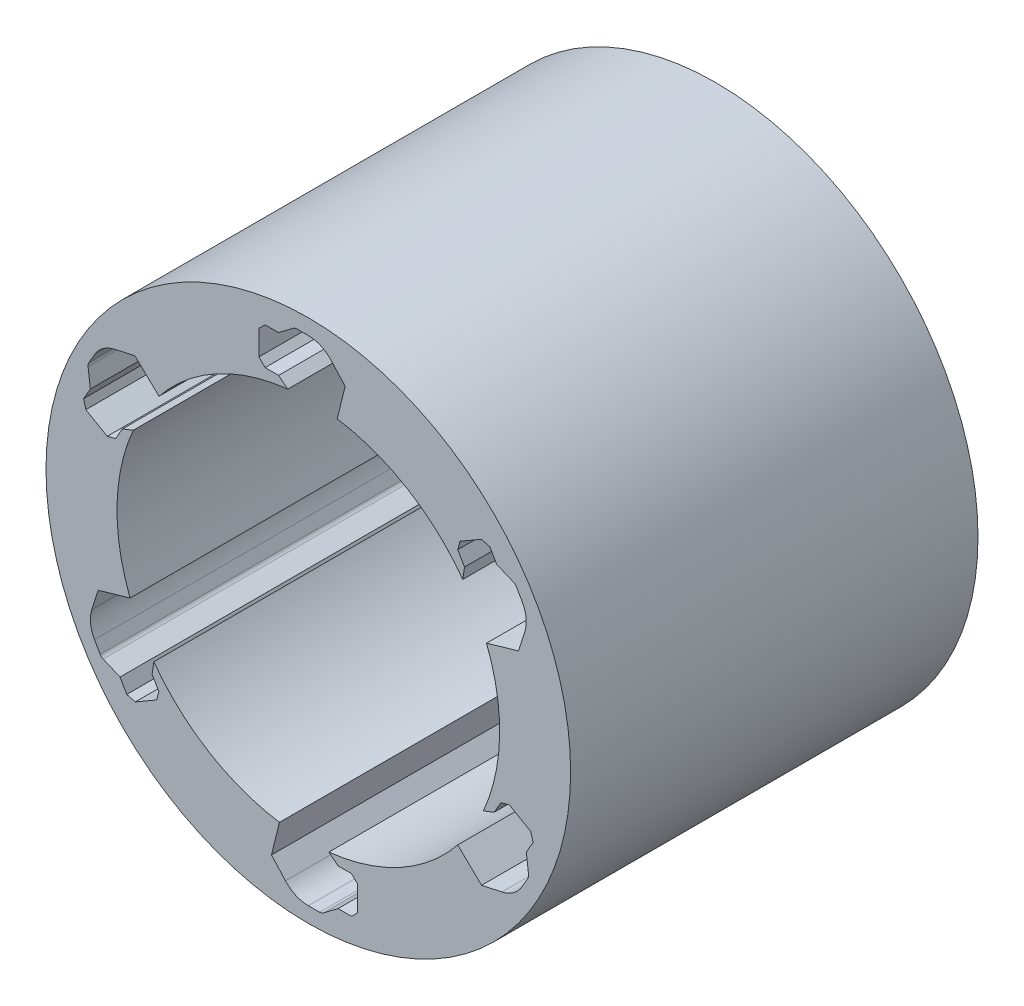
ISO-10303-21;
HEADER;
FILE_DESCRIPTION(('STEP AP214'),'2;1');
FILE_NAME('part.step','',(''),(''),'','','');
FILE_SCHEMA(('AUTOMOTIVE_DESIGN { 1 0 10303 214 1 1 1 1 }'));
ENDSEC;
DATA;
#1=APPLICATION_CONTEXT('core data for automotive mechanical design processes');
#2=APPLICATION_PROTOCOL_DEFINITION('international standard','automotive_design',2000,#1);
#3=PRODUCT_CONTEXT('',#1,'mechanical');
#4=PRODUCT('Part','Part','',(#3));
#5=PRODUCT_RELATED_PRODUCT_CATEGORY('part','',(#4));
#6=PRODUCT_DEFINITION_FORMATION('','',#4);
#7=PRODUCT_DEFINITION_CONTEXT('part definition',#1,'design');
#8=PRODUCT_DEFINITION('design','',#6,#7);
#9=PRODUCT_DEFINITION_SHAPE('','',#8);
#10=(LENGTH_UNIT() NAMED_UNIT(*) SI_UNIT(.MILLI.,.METRE.));
#11=(NAMED_UNIT(*) PLANE_ANGLE_UNIT() SI_UNIT($,.RADIAN.));
#12=(NAMED_UNIT(*) SI_UNIT($,.STERADIAN.) SOLID_ANGLE_UNIT());
#13=UNCERTAINTY_MEASURE_WITH_UNIT(LENGTH_MEASURE(1.E-05),#10,'distance_accuracy_value','');
#14=(GEOMETRIC_REPRESENTATION_CONTEXT(3) GLOBAL_UNCERTAINTY_ASSIGNED_CONTEXT((#13)) GLOBAL_UNIT_ASSIGNED_CONTEXT((#10,
#11,#12)) REPRESENTATION_CONTEXT('',''));
#15=CARTESIAN_POINT('',(0.,0.,0.));
#16=DIRECTION('',(0.,0.,1.));
#17=DIRECTION('',(1.,0.,0.));
#18=AXIS2_PLACEMENT_3D('',#15,#16,#17);
#19=CARTESIAN_POINT('',(0.,0.,6.6));
#20=DIRECTION('',(0.,0.,-1.));
#21=DIRECTION('',(-1.,0.,0.));
#22=AXIS2_PLACEMENT_3D('',#19,#20,#21);
#23=CYLINDRICAL_SURFACE('',#22,3.1);
#24=DIRECTION('',(0.,0.,1.));
#25=VECTOR('',#24,1.);
#26=CARTESIAN_POINT('',(-2.83537047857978,1.25326543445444,0.));
#27=LINE('',#26,#25);
#28=CARTESIAN_POINT('',(-2.83537047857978,1.25326543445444,0.));
#29=VERTEX_POINT('',#28);
#30=CARTESIAN_POINT('',(-2.83537047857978,1.25326543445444,6.6));
#31=VERTEX_POINT('',#30);
#32=EDGE_CURVE('E1373',#29,#31,#27,.T.);
#33=ORIENTED_EDGE('',*,*,#32,.T.);
#34=CARTESIAN_POINT('',(0.,0.,6.6));
#35=DIRECTION('',(0.,0.,1.));
#36=DIRECTION('',(1.,0.,0.));
#37=AXIS2_PLACEMENT_3D('',#34,#35,#36);
#38=CIRCLE('',#37,3.1);
#39=CARTESIAN_POINT('',(-2.8877890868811,-1.12724185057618,6.6));
#40=VERTEX_POINT('',#39);
#41=EDGE_CURVE('E859',#31,#40,#38,.T.);
#42=ORIENTED_EDGE('',*,*,#41,.T.);
#43=DIRECTION('',(0.,0.,1.));
#44=VECTOR('',#43,1.);
#45=CARTESIAN_POINT('',(-2.8877890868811,-1.12724185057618,0.));
#46=LINE('',#45,#44);
#47=CARTESIAN_POINT('',(-2.8877890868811,-1.12724185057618,0.));
#48=VERTEX_POINT('',#47);
#49=EDGE_CURVE('E1277',#48,#40,#46,.T.);
#50=ORIENTED_EDGE('',*,*,#49,.F.);
#51=CARTESIAN_POINT('',(0.,0.,0.));
#52=DIRECTION('',(0.,0.,1.));
#53=DIRECTION('',(1.,0.,0.));
#54=AXIS2_PLACEMENT_3D('',#51,#52,#53);
#55=CIRCLE('',#54,3.1);
#56=EDGE_CURVE('E371',#29,#48,#55,.T.);
#57=ORIENTED_EDGE('',*,*,#56,.F.);
#58=EDGE_LOOP('',(#33,#42,#50,#57));
#59=FACE_BOUND('',#58,.T.);
#60=ADVANCED_FACE('F348',(#59),#23,.F.);
#61=DIRECTION('',(0.,0.,1.));
#62=VECTOR('',#61,1.);
#63=CARTESIAN_POINT('',(-2.50304494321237,-1.82887014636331,0.));
#64=LINE('',#63,#62);
#65=CARTESIAN_POINT('',(-2.50304494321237,-1.82887014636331,0.));
#66=VERTEX_POINT('',#65);
#67=CARTESIAN_POINT('',(-2.50304494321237,-1.82887014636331,6.6));
#68=VERTEX_POINT('',#67);
#69=EDGE_CURVE('E1276',#66,#68,#64,.T.);
#70=ORIENTED_EDGE('',*,*,#69,.T.);
#71=CARTESIAN_POINT('',(-0.467674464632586,-3.06451963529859,6.6));
#72=VERTEX_POINT('',#71);
#73=EDGE_CURVE('E863',#68,#72,#38,.T.);
#74=ORIENTED_EDGE('',*,*,#73,.T.);
#75=DIRECTION('',(0.,0.,1.));
#76=VECTOR('',#75,1.);
#77=CARTESIAN_POINT('',(-0.467674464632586,-3.06451963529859,0.));
#78=LINE('',#77,#76);
#79=CARTESIAN_POINT('',(-0.467674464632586,-3.06451963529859,0.));
#80=VERTEX_POINT('',#79);
#81=EDGE_CURVE('E1178',#80,#72,#78,.T.);
#82=ORIENTED_EDGE('',*,*,#81,.F.);
#83=EDGE_CURVE('E875',#66,#80,#55,.T.);
#84=ORIENTED_EDGE('',*,*,#83,.F.);
#85=EDGE_LOOP('',(#70,#74,#82,#84));
#86=FACE_BOUND('',#85,.T.);
#87=ADVANCED_FACE('F1483',(#86),#23,.F.);
#88=DIRECTION('',(0.,0.,1.));
#89=VECTOR('',#88,1.);
#90=CARTESIAN_POINT('',(0.332325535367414,-3.08213558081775,0.));
#91=LINE('',#90,#89);
#92=CARTESIAN_POINT('',(0.332325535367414,-3.08213558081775,0.));
#93=VERTEX_POINT('',#92);
#94=CARTESIAN_POINT('',(0.332325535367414,-3.08213558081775,6.6));
#95=VERTEX_POINT('',#94);
#96=EDGE_CURVE('E1177',#93,#95,#91,.T.);
#97=ORIENTED_EDGE('',*,*,#96,.T.);
#98=CARTESIAN_POINT('',(2.42011462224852,-1.9372777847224,6.6));
#99=VERTEX_POINT('',#98);
#100=EDGE_CURVE('E872',#95,#99,#38,.T.);
#101=ORIENTED_EDGE('',*,*,#100,.T.);
#102=DIRECTION('',(0.,0.,1.));
#103=VECTOR('',#102,1.);
#104=CARTESIAN_POINT('',(2.42011462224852,-1.9372777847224,0.));
#105=LINE('',#104,#103);
#106=CARTESIAN_POINT('',(2.42011462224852,-1.9372777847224,0.));
#107=VERTEX_POINT('',#106);
#108=EDGE_CURVE('E1079',#107,#99,#105,.T.);
#109=ORIENTED_EDGE('',*,*,#108,.F.);
#110=EDGE_CURVE('E882',#93,#107,#55,.T.);
#111=ORIENTED_EDGE('',*,*,#110,.F.);
#112=EDGE_LOOP('',(#97,#101,#109,#111));
#113=FACE_BOUND('',#112,.T.);
#114=ADVANCED_FACE('F1489',(#113),#23,.F.);
#115=DIRECTION('',(0.,0.,1.));
#116=VECTOR('',#115,1.);
#117=CARTESIAN_POINT('',(2.83537047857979,-1.25326543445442,0.));
#118=LINE('',#117,#116);
#119=CARTESIAN_POINT('',(2.83537047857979,-1.25326543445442,0.));
#120=VERTEX_POINT('',#119);
#121=CARTESIAN_POINT('',(2.83537047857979,-1.25326543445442,6.6));
#122=VERTEX_POINT('',#121);
#123=EDGE_CURVE('E1078',#120,#122,#118,.T.);
#124=ORIENTED_EDGE('',*,*,#123,.T.);
#125=CARTESIAN_POINT('',(2.88778908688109,1.1272418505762,6.6));
#126=VERTEX_POINT('',#125);
#127=EDGE_CURVE('E865',#122,#126,#38,.T.);
#128=ORIENTED_EDGE('',*,*,#127,.T.);
#129=DIRECTION('',(0.,0.,1.));
#130=VECTOR('',#129,1.);
#131=CARTESIAN_POINT('',(2.88778908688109,1.1272418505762,0.));
#132=LINE('',#131,#130);
#133=CARTESIAN_POINT('',(2.88778908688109,1.1272418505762,0.));
#134=VERTEX_POINT('',#133);
#135=EDGE_CURVE('E982',#134,#126,#132,.T.);
#136=ORIENTED_EDGE('',*,*,#135,.F.);
#137=EDGE_CURVE('E877',#120,#134,#55,.T.);
#138=ORIENTED_EDGE('',*,*,#137,.F.);
#139=EDGE_LOOP('',(#124,#128,#136,#138));
#140=FACE_BOUND('',#139,.T.);
#141=ADVANCED_FACE('F1501',(#140),#23,.F.);
#142=DIRECTION('',(0.,0.,1.));
#143=VECTOR('',#142,1.);
#144=CARTESIAN_POINT('',(2.50304494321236,1.82887014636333,0.));
#145=LINE('',#144,#143);
#146=CARTESIAN_POINT('',(2.50304494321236,1.82887014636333,0.));
#147=VERTEX_POINT('',#146);
#148=CARTESIAN_POINT('',(2.50304494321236,1.82887014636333,6.6));
#149=VERTEX_POINT('',#148);
#150=EDGE_CURVE('E981',#147,#149,#145,.T.);
#151=ORIENTED_EDGE('',*,*,#150,.T.);
#152=CARTESIAN_POINT('',(0.467674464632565,3.0645196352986,6.6));
#153=VERTEX_POINT('',#152);
#154=EDGE_CURVE('E861',#149,#153,#38,.T.);
#155=ORIENTED_EDGE('',*,*,#154,.T.);
#156=DIRECTION('',(0.,0.,1.));
#157=VECTOR('',#156,1.);
#158=CARTESIAN_POINT('',(0.467674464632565,3.0645196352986,0.));
#159=LINE('',#158,#157);
#160=CARTESIAN_POINT('',(0.467674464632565,3.0645196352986,0.));
#161=VERTEX_POINT('',#160);
#162=EDGE_CURVE('E909',#161,#153,#159,.T.);
#163=ORIENTED_EDGE('',*,*,#162,.F.);
#164=EDGE_CURVE('E873',#147,#161,#55,.T.);
#165=ORIENTED_EDGE('',*,*,#164,.F.);
#166=EDGE_LOOP('',(#151,#155,#163,#165));
#167=FACE_BOUND('',#166,.T.);
#168=ADVANCED_FACE('F1479',(#167),#23,.F.);
#169=CARTESIAN_POINT('',(0.,0.,6.6));
#170=DIRECTION('',(0.,0.,1.));
#171=DIRECTION('',(1.,0.,0.));
#172=AXIS2_PLACEMENT_3D('',#169,#170,#171);
#173=PLANE('',#172);
#174=DIRECTION('',(0.929449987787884,0.368948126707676,0.));
#175=VECTOR('',#174,1.);
#176=CARTESIAN_POINT('',(-2.83537047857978,1.25326543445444,6.6));
#177=LINE('',#176,#175);
#178=CARTESIAN_POINT('',(-3.0119334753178,1.18317819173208,6.6));
#179=VERTEX_POINT('',#178);
#180=EDGE_CURVE('E1430',#179,#31,#177,.T.);
#181=ORIENTED_EDGE('',*,*,#180,.F.);
#182=DIRECTION('',(0.500000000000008,0.866025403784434,0.));
#183=VECTOR('',#182,1.);
#184=CARTESIAN_POINT('',(-3.0119334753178,1.18317819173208,6.6));
#185=LINE('',#184,#183);
#186=CARTESIAN_POINT('',(-3.12128129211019,0.993782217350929,6.6));
#187=VERTEX_POINT('',#186);
#188=EDGE_CURVE('E1432',#187,#179,#185,.T.);
#189=ORIENTED_EDGE('',*,*,#188,.F.);
#190=DIRECTION('',(0.965925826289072,0.258819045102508,0.));
#191=VECTOR('',#190,1.);
#192=CARTESIAN_POINT('',(-3.12128129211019,0.993782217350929,6.6));
#193=LINE('',#192,#191);
#194=CARTESIAN_POINT('',(-3.25788383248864,0.957179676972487,6.6));
#195=VERTEX_POINT('',#194);
#196=EDGE_CURVE('E1435',#195,#187,#193,.T.);
#197=ORIENTED_EDGE('',*,*,#196,.F.);
#198=DIRECTION('',(0.866025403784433,-0.50000000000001,0.));
#199=VECTOR('',#198,1.);
#200=CARTESIAN_POINT('',(-3.25788383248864,0.957179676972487,6.6));
#201=LINE('',#200,#199);
#202=CARTESIAN_POINT('',(-3.60429399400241,1.15717967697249,6.6));
#203=VERTEX_POINT('',#202);
#204=EDGE_CURVE('E1438',#203,#195,#201,.T.);
#205=ORIENTED_EDGE('',*,*,#204,.F.);
#206=DIRECTION('',(0.258819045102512,-0.965925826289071,0.));
#207=VECTOR('',#206,1.);
#208=CARTESIAN_POINT('',(-3.64089653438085,1.29378221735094,6.6));
#209=LINE('',#208,#207);
#210=CARTESIAN_POINT('',(-3.64089653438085,1.29378221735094,6.6));
#211=VERTEX_POINT('',#210);
#212=EDGE_CURVE('E1441',#211,#203,#209,.T.);
#213=ORIENTED_EDGE('',*,*,#212,.F.);
#214=DIRECTION('',(-0.500000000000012,-0.866025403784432,0.));
#215=VECTOR('',#214,1.);
#216=CARTESIAN_POINT('',(-3.53154871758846,1.48317819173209,6.6));
#217=LINE('',#216,#215);
#218=CARTESIAN_POINT('',(-3.53154871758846,1.48317819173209,6.6));
#219=VERTEX_POINT('',#218);
#220=EDGE_CURVE('E1444',#219,#211,#217,.T.);
#221=ORIENTED_EDGE('',*,*,#220,.F.);
#222=DIRECTION('',(0.124217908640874,-0.992254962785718,0.));
#223=VECTOR('',#222,1.);
#224=CARTESIAN_POINT('',(-3.53154871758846,1.48317819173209,6.6));
#225=LINE('',#224,#223);
#226=CARTESIAN_POINT('',(-3.56852806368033,1.77856989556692,6.6));
#227=VERTEX_POINT('',#226);
#228=EDGE_CURVE('E1447',#227,#219,#225,.T.);
#229=ORIENTED_EDGE('',*,*,#228,.F.);
#230=CARTESIAN_POINT('',(-3.46930256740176,1.79099168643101,6.6));
#231=DIRECTION('',(0.,0.,1.));
#232=DIRECTION('',(0.50000000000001,0.866025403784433,0.));
#233=AXIS2_PLACEMENT_3D('',#230,#231,#232);
#234=CIRCLE('',#233,0.1);
#235=CARTESIAN_POINT('',(-3.5559051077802,1.84099168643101,6.6));
#236=VERTEX_POINT('',#235);
#237=EDGE_CURVE('E1450',#236,#227,#234,.T.);
#238=ORIENTED_EDGE('',*,*,#237,.F.);
#239=DIRECTION('',(-0.50000000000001,-0.866025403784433,0.));
#240=VECTOR('',#239,1.);
#241=CARTESIAN_POINT('',(-3.5559051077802,1.84099168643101,6.6));
#242=LINE('',#241,#240);
#243=CARTESIAN_POINT('',(-3.46410161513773,2.00000000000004,6.6));
#244=VERTEX_POINT('',#243);
#245=EDGE_CURVE('E1453',#244,#236,#242,.T.);
#246=ORIENTED_EDGE('',*,*,#245,.F.);
#247=CARTESIAN_POINT('',(-3.03108891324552,1.75000000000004,6.6));
#248=DIRECTION('',(0.,0.,1.));
#249=DIRECTION('',(-0.50000000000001,-0.866025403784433,0.));
#250=AXIS2_PLACEMENT_3D('',#247,#248,#249);
#251=CIRCLE('',#250,0.5);
#252=CARTESIAN_POINT('',(-3.13680071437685,2.23869726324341,6.6));
#253=VERTEX_POINT('',#252);
#254=EDGE_CURVE('E1456',#253,#244,#251,.T.);
#255=ORIENTED_EDGE('',*,*,#254,.F.);
#256=DIRECTION('',(-0.977394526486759,-0.211423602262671,0.));
#257=VECTOR('',#256,1.);
#258=CARTESIAN_POINT('',(-3.13680071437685,2.23869726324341,6.6));
#259=LINE('',#258,#257);
#260=CARTESIAN_POINT('',(-2.80759457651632,2.30990898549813,6.6));
#261=VERTEX_POINT('',#260);
#262=EDGE_CURVE('E854',#261,#253,#259,.T.);
#263=ORIENTED_EDGE('',*,*,#262,.F.);
#264=DIRECTION('',(-0.720782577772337,0.693161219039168,0.));
#265=VECTOR('',#264,1.);
#266=CARTESIAN_POINT('',(-2.80759457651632,2.30990898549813,6.6));
#267=LINE('',#266,#265);
#268=CARTESIAN_POINT('',(-2.4201146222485,1.93727778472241,6.6));
#269=VERTEX_POINT('',#268);
#270=EDGE_CURVE('E836',#269,#261,#267,.T.);
#271=ORIENTED_EDGE('',*,*,#270,.F.);
#272=CARTESIAN_POINT('',(-0.332325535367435,3.08213558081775,6.6));
#273=VERTEX_POINT('',#272);
#274=EDGE_CURVE('E851',#273,#269,#38,.T.);
#275=ORIENTED_EDGE('',*,*,#274,.F.);
#276=DIRECTION('',(0.784243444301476,-0.620453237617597,0.));
#277=VECTOR('',#276,1.);
#278=CARTESIAN_POINT('',(-0.332325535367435,3.08213558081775,6.6));
#279=LINE('',#278,#277);
#280=CARTESIAN_POINT('',(-0.481304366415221,3.2,6.6));
#281=VERTEX_POINT('',#280);
#282=EDGE_CURVE('E947',#281,#273,#279,.T.);
#283=ORIENTED_EDGE('',*,*,#282,.F.);
#284=DIRECTION('',(1.,0.,0.));
#285=VECTOR('',#284,1.);
#286=CARTESIAN_POINT('',(-0.481304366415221,3.2,6.6));
#287=LINE('',#286,#285);
#288=CARTESIAN_POINT('',(-0.7,3.2,6.6));
#289=VERTEX_POINT('',#288);
#290=EDGE_CURVE('E949',#289,#281,#287,.T.);
#291=ORIENTED_EDGE('',*,*,#290,.F.);
#292=DIRECTION('',(0.707106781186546,-0.707106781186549,0.));
#293=VECTOR('',#292,1.);
#294=CARTESIAN_POINT('',(-0.7,3.2,6.6));
#295=LINE('',#294,#293);
#296=CARTESIAN_POINT('',(-0.8,3.3,6.6));
#297=VERTEX_POINT('',#296);
#298=EDGE_CURVE('E952',#297,#289,#295,.T.);
#299=ORIENTED_EDGE('',*,*,#298,.F.);
#300=DIRECTION('',(0.,-1.,0.));
#301=VECTOR('',#300,1.);
#302=CARTESIAN_POINT('',(-0.8,3.3,6.6));
#303=LINE('',#302,#301);
#304=CARTESIAN_POINT('',(-0.8,3.7,6.6));
#305=VERTEX_POINT('',#304);
#306=EDGE_CURVE('E955',#305,#297,#303,.T.);
#307=ORIENTED_EDGE('',*,*,#306,.F.);
#308=DIRECTION('',(-0.707106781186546,-0.707106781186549,0.));
#309=VECTOR('',#308,1.);
#310=CARTESIAN_POINT('',(-0.7,3.8,6.6));
#311=LINE('',#310,#309);
#312=CARTESIAN_POINT('',(-0.7,3.8,6.6));
#313=VERTEX_POINT('',#312);
#314=EDGE_CURVE('E958',#313,#305,#311,.T.);
#315=ORIENTED_EDGE('',*,*,#314,.F.);
#316=DIRECTION('',(-1.,0.,0.));
#317=VECTOR('',#316,1.);
#318=CARTESIAN_POINT('',(-0.481304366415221,3.8,6.6));
#319=LINE('',#318,#317);
#320=CARTESIAN_POINT('',(-0.481304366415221,3.8,6.6));
#321=VERTEX_POINT('',#320);
#322=EDGE_CURVE('E961',#321,#313,#319,.T.);
#323=ORIENTED_EDGE('',*,*,#322,.F.);
#324=DIRECTION('',(-0.797209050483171,-0.60370334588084,0.));
#325=VECTOR('',#324,1.);
#326=CARTESIAN_POINT('',(-0.481304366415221,3.8,6.6));
#327=LINE('',#326,#325);
#328=CARTESIAN_POINT('',(-0.243977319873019,3.97972090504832,6.6));
#329=VERTEX_POINT('',#328);
#330=EDGE_CURVE('E964',#329,#321,#327,.T.);
#331=ORIENTED_EDGE('',*,*,#330,.F.);
#332=CARTESIAN_POINT('',(-0.183606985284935,3.9,6.6));
#333=DIRECTION('',(0.,0.,1.));
#334=DIRECTION('',(1.,0.,0.));
#335=AXIS2_PLACEMENT_3D('',#332,#333,#334);
#336=CIRCLE('',#335,0.1);
#337=CARTESIAN_POINT('',(-0.183606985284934,4.,6.6));
#338=VERTEX_POINT('',#337);
#339=EDGE_CURVE('E967',#338,#329,#336,.T.);
#340=ORIENTED_EDGE('',*,*,#339,.F.);
#341=DIRECTION('',(-1.,0.,0.));
#342=VECTOR('',#341,1.);
#343=CARTESIAN_POINT('',(-0.183606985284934,4.,6.6));
#344=LINE('',#343,#342);
#345=CARTESIAN_POINT('',(0.,4.,6.6));
#346=VERTEX_POINT('',#345);
#347=EDGE_CURVE('E970',#346,#338,#344,.T.);
#348=ORIENTED_EDGE('',*,*,#347,.F.);
#349=CARTESIAN_POINT('',(0.,3.5,6.6));
#350=DIRECTION('',(0.,0.,1.));
#351=DIRECTION('',(-1.,0.,0.));
#352=AXIS2_PLACEMENT_3D('',#349,#350,#351);
#353=CIRCLE('',#352,0.5);
#354=CARTESIAN_POINT('',(0.370368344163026,3.83589773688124,6.6));
#355=VERTEX_POINT('',#354);
#356=EDGE_CURVE('E973',#355,#346,#353,.T.);
#357=ORIENTED_EDGE('',*,*,#356,.F.);
#358=DIRECTION('',(-0.671795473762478,0.740736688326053,0.));
#359=VECTOR('',#358,1.);
#360=CARTESIAN_POINT('',(0.370368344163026,3.83589773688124,6.6));
#361=LINE('',#360,#359);
#362=CARTESIAN_POINT('',(0.596642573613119,3.58640271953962,6.6));
#363=VERTEX_POINT('',#362);
#364=EDGE_CURVE('E976',#363,#355,#361,.T.);
#365=ORIENTED_EDGE('',*,*,#364,.F.);
#366=DIRECTION('',(0.239903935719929,0.970796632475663,0.));
#367=VECTOR('',#366,1.);
#368=CARTESIAN_POINT('',(0.596642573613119,3.58640271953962,6.6));
#369=LINE('',#368,#367);
#370=EDGE_CURVE('E979',#153,#363,#369,.T.);
#371=ORIENTED_EDGE('',*,*,#370,.F.);
#372=ORIENTED_EDGE('',*,*,#154,.F.);
#373=DIRECTION('',(-0.145206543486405,-0.989401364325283,0.));
#374=VECTOR('',#373,1.);
#375=CARTESIAN_POINT('',(2.50304494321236,1.82887014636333,6.6));
#376=LINE('',#375,#374);
#377=CARTESIAN_POINT('',(2.5306291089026,2.01682180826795,6.6));
#378=VERTEX_POINT('',#377);
#379=EDGE_CURVE('E1043',#378,#149,#376,.T.);
#380=ORIENTED_EDGE('',*,*,#379,.F.);
#381=DIRECTION('',(0.5,-0.866025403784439,0.));
#382=VECTOR('',#381,1.);
#383=CARTESIAN_POINT('',(2.5306291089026,2.01682180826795,6.6));
#384=LINE('',#383,#382);
#385=CARTESIAN_POINT('',(2.42128129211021,2.2062177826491,6.6));
#386=VERTEX_POINT('',#385);
#387=EDGE_CURVE('E1045',#386,#378,#384,.T.);
#388=ORIENTED_EDGE('',*,*,#387,.F.);
#389=DIRECTION('',(-0.258819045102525,-0.965925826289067,0.));
#390=VECTOR('',#389,1.);
#391=CARTESIAN_POINT('',(2.42128129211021,2.2062177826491,6.6));
#392=LINE('',#391,#390);
#393=CARTESIAN_POINT('',(2.45788383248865,2.34282032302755,6.6));
#394=VERTEX_POINT('',#393);
#395=EDGE_CURVE('E1048',#394,#386,#392,.T.);
#396=ORIENTED_EDGE('',*,*,#395,.F.);
#397=DIRECTION('',(-0.86602540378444,-0.499999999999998,0.));
#398=VECTOR('',#397,1.);
#399=CARTESIAN_POINT('',(2.45788383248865,2.34282032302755,6.6));
#400=LINE('',#399,#398);
#401=CARTESIAN_POINT('',(2.80429399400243,2.54282032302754,6.6));
#402=VERTEX_POINT('',#401);
#403=EDGE_CURVE('E1051',#402,#394,#400,.T.);
#404=ORIENTED_EDGE('',*,*,#403,.F.);
#405=DIRECTION('',(-0.965925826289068,0.258819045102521,0.));
#406=VECTOR('',#405,1.);
#407=CARTESIAN_POINT('',(2.94089653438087,2.5062177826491,6.6));
#408=LINE('',#407,#406);
#409=CARTESIAN_POINT('',(2.94089653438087,2.5062177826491,6.6));
#410=VERTEX_POINT('',#409);
#411=EDGE_CURVE('E1054',#410,#402,#408,.T.);
#412=ORIENTED_EDGE('',*,*,#411,.F.);
#413=DIRECTION('',(-0.499999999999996,0.866025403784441,0.));
#414=VECTOR('',#413,1.);
#415=CARTESIAN_POINT('',(3.05024435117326,2.31682180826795,6.6));
#416=LINE('',#415,#414);
#417=CARTESIAN_POINT('',(3.05024435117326,2.31682180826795,6.6));
#418=VERTEX_POINT('',#417);
#419=EDGE_CURVE('E1057',#418,#410,#416,.T.);
#420=ORIENTED_EDGE('',*,*,#419,.F.);
#421=DIRECTION('',(-0.921426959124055,0.388551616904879,0.));
#422=VECTOR('',#421,1.);
#423=CARTESIAN_POINT('',(3.05024435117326,2.31682180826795,6.6));
#424=LINE('',#423,#422);
#425=CARTESIAN_POINT('',(3.32455074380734,2.20115100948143,6.6));
#426=VERTEX_POINT('',#425);
#427=EDGE_CURVE('E1060',#426,#418,#424,.T.);
#428=ORIENTED_EDGE('',*,*,#427,.F.);
#429=CARTESIAN_POINT('',(3.28569558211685,2.10900831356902,6.6));
#430=DIRECTION('',(0.,0.,1.));
#431=DIRECTION('',(0.499999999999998,-0.86602540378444,0.));
#432=AXIS2_PLACEMENT_3D('',#429,#430,#431);
#433=CIRCLE('',#432,0.1);
#434=CARTESIAN_POINT('',(3.37229812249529,2.15900831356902,6.6));
#435=VERTEX_POINT('',#434);
#436=EDGE_CURVE('E1063',#435,#426,#433,.T.);
#437=ORIENTED_EDGE('',*,*,#436,.F.);
#438=DIRECTION('',(-0.499999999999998,0.86602540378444,0.));
#439=VECTOR('',#438,1.);
#440=CARTESIAN_POINT('',(3.37229812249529,2.15900831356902,6.6));
#441=LINE('',#440,#439);
#442=CARTESIAN_POINT('',(3.46410161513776,1.99999999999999,6.6));
#443=VERTEX_POINT('',#442);
#444=EDGE_CURVE('E1066',#443,#435,#441,.T.);
#445=ORIENTED_EDGE('',*,*,#444,.F.);
#446=CARTESIAN_POINT('',(3.03108891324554,1.74999999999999,6.6));
#447=DIRECTION('',(0.,0.,1.));
#448=DIRECTION('',(-0.499999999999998,0.86602540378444,0.));
#449=AXIS2_PLACEMENT_3D('',#446,#447,#448);
#450=CIRCLE('',#449,0.5);
#451=CARTESIAN_POINT('',(3.50716905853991,1.59720047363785,6.6));
#452=VERTEX_POINT('',#451);
#453=EDGE_CURVE('E1069',#452,#443,#450,.T.);
#454=ORIENTED_EDGE('',*,*,#453,.F.);
#455=DIRECTION('',(0.305599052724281,0.952160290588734,0.));
#456=VECTOR('',#455,1.);
#457=CARTESIAN_POINT('',(3.50716905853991,1.59720047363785,6.6));
#458=LINE('',#457,#456);
#459=CARTESIAN_POINT('',(3.40423715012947,1.27649373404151,6.6));
#460=VERTEX_POINT('',#459);
#461=EDGE_CURVE('E1072',#460,#452,#458,.T.);
#462=ORIENTED_EDGE('',*,*,#461,.F.);
#463=DIRECTION('',(0.960686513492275,0.277635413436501,0.));
#464=VECTOR('',#463,1.);
#465=CARTESIAN_POINT('',(3.40423715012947,1.27649373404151,6.6));
#466=LINE('',#465,#464);
#467=EDGE_CURVE('E1075',#126,#460,#466,.T.);
#468=ORIENTED_EDGE('',*,*,#467,.F.);
#469=ORIENTED_EDGE('',*,*,#127,.F.);
#470=DIRECTION('',(-0.929449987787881,-0.368948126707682,0.));
#471=VECTOR('',#470,1.);
#472=CARTESIAN_POINT('',(2.83537047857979,-1.25326543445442,6.6));
#473=LINE('',#472,#471);
#474=CARTESIAN_POINT('',(3.01193347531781,-1.18317819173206,6.6));
#475=VERTEX_POINT('',#474);
#476=EDGE_CURVE('E1142',#475,#122,#473,.T.);
#477=ORIENTED_EDGE('',*,*,#476,.F.);
#478=DIRECTION('',(-0.500000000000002,-0.866025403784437,0.));
#479=VECTOR('',#478,1.);
#480=CARTESIAN_POINT('',(3.01193347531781,-1.18317819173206,6.6));
#481=LINE('',#480,#479);
#482=CARTESIAN_POINT('',(3.1212812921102,-0.993782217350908,6.6));
#483=VERTEX_POINT('',#482);
#484=EDGE_CURVE('E1144',#483,#475,#481,.T.);
#485=ORIENTED_EDGE('',*,*,#484,.F.);
#486=DIRECTION('',(-0.96592582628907,-0.258819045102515,0.));
#487=VECTOR('',#486,1.);
#488=CARTESIAN_POINT('',(3.1212812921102,-0.993782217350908,6.6));
#489=LINE('',#488,#487);
#490=CARTESIAN_POINT('',(3.25788383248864,-0.957179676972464,6.6));
#491=VERTEX_POINT('',#490);
#492=EDGE_CURVE('E1147',#491,#483,#489,.T.);
#493=ORIENTED_EDGE('',*,*,#492,.F.);
#494=DIRECTION('',(-0.866025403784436,0.500000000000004,0.));
#495=VECTOR('',#494,1.);
#496=CARTESIAN_POINT('',(3.25788383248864,-0.957179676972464,6.6));
#497=LINE('',#496,#495);
#498=CARTESIAN_POINT('',(3.60429399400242,-1.15717967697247,6.6));
#499=VERTEX_POINT('',#498);
#500=EDGE_CURVE('E1150',#499,#491,#497,.T.);
#501=ORIENTED_EDGE('',*,*,#500,.F.);
#502=DIRECTION('',(-0.258819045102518,0.965925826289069,0.));
#503=VECTOR('',#502,1.);
#504=CARTESIAN_POINT('',(3.64089653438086,-1.29378221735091,6.6));
#505=LINE('',#504,#503);
#506=CARTESIAN_POINT('',(3.64089653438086,-1.29378221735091,6.6));
#507=VERTEX_POINT('',#506);
#508=EDGE_CURVE('E1153',#507,#499,#505,.T.);
#509=ORIENTED_EDGE('',*,*,#508,.F.);
#510=DIRECTION('',(0.500000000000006,0.866025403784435,0.));
#511=VECTOR('',#510,1.);
#512=CARTESIAN_POINT('',(3.53154871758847,-1.48317819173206,6.6));
#513=LINE('',#512,#511);
#514=CARTESIAN_POINT('',(3.53154871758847,-1.48317819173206,6.6));
#515=VERTEX_POINT('',#514);
#516=EDGE_CURVE('E1156',#515,#507,#513,.T.);
#517=ORIENTED_EDGE('',*,*,#516,.F.);
#518=DIRECTION('',(-0.124217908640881,0.992254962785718,0.));
#519=VECTOR('',#518,1.);
#520=CARTESIAN_POINT('',(3.53154871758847,-1.48317819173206,6.6));
#521=LINE('',#520,#519);
#522=CARTESIAN_POINT('',(3.56852806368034,-1.7785698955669,6.6));
#523=VERTEX_POINT('',#522);
#524=EDGE_CURVE('E1159',#523,#515,#521,.T.);
#525=ORIENTED_EDGE('',*,*,#524,.F.);
#526=CARTESIAN_POINT('',(3.46930256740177,-1.79099168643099,6.6));
#527=DIRECTION('',(0.,0.,1.));
#528=DIRECTION('',(-0.500000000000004,-0.866025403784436,0.));
#529=AXIS2_PLACEMENT_3D('',#526,#527,#528);
#530=CIRCLE('',#529,0.1);
#531=CARTESIAN_POINT('',(3.55590510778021,-1.84099168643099,6.6));
#532=VERTEX_POINT('',#531);
#533=EDGE_CURVE('E1162',#532,#523,#530,.T.);
#534=ORIENTED_EDGE('',*,*,#533,.F.);
#535=DIRECTION('',(0.500000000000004,0.866025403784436,0.));
#536=VECTOR('',#535,1.);
#537=CARTESIAN_POINT('',(3.55590510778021,-1.84099168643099,6.6));
#538=LINE('',#537,#536);
#539=CARTESIAN_POINT('',(3.46410161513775,-2.00000000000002,6.6));
#540=VERTEX_POINT('',#539);
#541=EDGE_CURVE('E1165',#540,#532,#538,.T.);
#542=ORIENTED_EDGE('',*,*,#541,.F.);
#543=CARTESIAN_POINT('',(3.03108891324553,-1.75000000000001,6.6));
#544=DIRECTION('',(0.,0.,1.));
#545=DIRECTION('',(0.500000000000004,0.866025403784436,0.));
#546=AXIS2_PLACEMENT_3D('',#543,#544,#545);
#547=CIRCLE('',#546,0.5);
#548=CARTESIAN_POINT('',(3.13680071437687,-2.23869726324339,6.6));
#549=VERTEX_POINT('',#548);
#550=EDGE_CURVE('E1168',#549,#540,#547,.T.);
#551=ORIENTED_EDGE('',*,*,#550,.F.);
#552=DIRECTION('',(0.977394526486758,0.211423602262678,0.));
#553=VECTOR('',#552,1.);
#554=CARTESIAN_POINT('',(3.13680071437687,-2.23869726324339,6.6));
#555=LINE('',#554,#553);
#556=CARTESIAN_POINT('',(2.80759457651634,-2.30990898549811,6.6));
#557=VERTEX_POINT('',#556);
#558=EDGE_CURVE('E1171',#557,#549,#555,.T.);
#559=ORIENTED_EDGE('',*,*,#558,.F.);
#560=DIRECTION('',(0.720782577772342,-0.693161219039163,0.));
#561=VECTOR('',#560,1.);
#562=CARTESIAN_POINT('',(2.80759457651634,-2.30990898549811,6.6));
#563=LINE('',#562,#561);
#564=EDGE_CURVE('E1174',#99,#557,#563,.T.);
#565=ORIENTED_EDGE('',*,*,#564,.F.);
#566=ORIENTED_EDGE('',*,*,#100,.F.);
#567=DIRECTION('',(-0.784243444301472,0.620453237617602,0.));
#568=VECTOR('',#567,1.);
#569=CARTESIAN_POINT('',(0.332325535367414,-3.08213558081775,6.6));
#570=LINE('',#569,#568);
#571=CARTESIAN_POINT('',(0.481304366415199,-3.2,6.6));
#572=VERTEX_POINT('',#571);
#573=EDGE_CURVE('E1241',#572,#95,#570,.T.);
#574=ORIENTED_EDGE('',*,*,#573,.F.);
#575=DIRECTION('',(-1.,0.,0.));
#576=VECTOR('',#575,1.);
#577=CARTESIAN_POINT('',(0.481304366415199,-3.2,6.6));
#578=LINE('',#577,#576);
#579=CARTESIAN_POINT('',(0.699999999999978,-3.2,6.6));
#580=VERTEX_POINT('',#579);
#581=EDGE_CURVE('E1243',#580,#572,#578,.T.);
#582=ORIENTED_EDGE('',*,*,#581,.F.);
#583=DIRECTION('',(-0.707106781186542,0.707106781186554,0.));
#584=VECTOR('',#583,1.);
#585=CARTESIAN_POINT('',(0.699999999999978,-3.2,6.6));
#586=LINE('',#585,#584);
#587=CARTESIAN_POINT('',(0.799999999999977,-3.30000000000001,6.6));
#588=VERTEX_POINT('',#587);
#589=EDGE_CURVE('E1246',#588,#580,#586,.T.);
#590=ORIENTED_EDGE('',*,*,#589,.F.);
#591=DIRECTION('',(0.,1.,0.));
#592=VECTOR('',#591,1.);
#593=CARTESIAN_POINT('',(0.799999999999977,-3.30000000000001,6.6));
#594=LINE('',#593,#592);
#595=CARTESIAN_POINT('',(0.799999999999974,-3.70000000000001,6.6));
#596=VERTEX_POINT('',#595);
#597=EDGE_CURVE('E1249',#596,#588,#594,.T.);
#598=ORIENTED_EDGE('',*,*,#597,.F.);
#599=DIRECTION('',(0.707106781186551,0.707106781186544,0.));
#600=VECTOR('',#599,1.);
#601=CARTESIAN_POINT('',(0.699999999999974,-3.80000000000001,6.6));
#602=LINE('',#601,#600);
#603=CARTESIAN_POINT('',(0.699999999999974,-3.80000000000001,6.6));
#604=VERTEX_POINT('',#603);
#605=EDGE_CURVE('E1252',#604,#596,#602,.T.);
#606=ORIENTED_EDGE('',*,*,#605,.F.);
#607=DIRECTION('',(1.,0.,0.));
#608=VECTOR('',#607,1.);
#609=CARTESIAN_POINT('',(0.481304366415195,-3.8,6.6));
#610=LINE('',#609,#608);
#611=CARTESIAN_POINT('',(0.481304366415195,-3.8,6.6));
#612=VERTEX_POINT('',#611);
#613=EDGE_CURVE('E1255',#612,#604,#610,.T.);
#614=ORIENTED_EDGE('',*,*,#613,.F.);
#615=DIRECTION('',(0.797209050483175,0.603703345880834,0.));
#616=VECTOR('',#615,1.);
#617=CARTESIAN_POINT('',(0.481304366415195,-3.8,6.6));
#618=LINE('',#617,#616);
#619=CARTESIAN_POINT('',(0.243977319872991,-3.97972090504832,6.6));
#620=VERTEX_POINT('',#619);
#621=EDGE_CURVE('E1258',#620,#612,#618,.T.);
#622=ORIENTED_EDGE('',*,*,#621,.F.);
#623=CARTESIAN_POINT('',(0.183606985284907,-3.9,6.6));
#624=DIRECTION('',(0.,0.,1.));
#625=DIRECTION('',(-1.,0.,0.));
#626=AXIS2_PLACEMENT_3D('',#623,#624,#625);
#627=CIRCLE('',#626,0.1);
#628=CARTESIAN_POINT('',(0.183606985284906,-4.,6.6));
#629=VERTEX_POINT('',#628);
#630=EDGE_CURVE('E1261',#629,#620,#627,.T.);
#631=ORIENTED_EDGE('',*,*,#630,.F.);
#632=DIRECTION('',(1.,0.,0.));
#633=VECTOR('',#632,1.);
#634=CARTESIAN_POINT('',(0.183606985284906,-4.,6.6));
#635=LINE('',#634,#633);
#636=CARTESIAN_POINT('',(0.,-4.,6.6));
#637=VERTEX_POINT('',#636);
#638=EDGE_CURVE('E1264',#637,#629,#635,.T.);
#639=ORIENTED_EDGE('',*,*,#638,.F.);
#640=CARTESIAN_POINT('',(0.,-3.5,6.6));
#641=DIRECTION('',(0.,0.,1.));
#642=DIRECTION('',(1.,0.,0.));
#643=AXIS2_PLACEMENT_3D('',#640,#641,#642);
#644=CIRCLE('',#643,0.5);
#645=CARTESIAN_POINT('',(-0.370368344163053,-3.83589773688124,6.6));
#646=VERTEX_POINT('',#645);
#647=EDGE_CURVE('E1267',#646,#637,#644,.T.);
#648=ORIENTED_EDGE('',*,*,#647,.F.);
#649=DIRECTION('',(0.671795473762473,-0.740736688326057,0.));
#650=VECTOR('',#649,1.);
#651=CARTESIAN_POINT('',(-0.370368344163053,-3.83589773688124,6.6));
#652=LINE('',#651,#650);
#653=CARTESIAN_POINT('',(-0.596642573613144,-3.58640271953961,6.6));
#654=VERTEX_POINT('',#653);
#655=EDGE_CURVE('E1270',#654,#646,#652,.T.);
#656=ORIENTED_EDGE('',*,*,#655,.F.);
#657=DIRECTION('',(-0.239903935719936,-0.970796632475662,0.));
#658=VECTOR('',#657,1.);
#659=CARTESIAN_POINT('',(-0.596642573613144,-3.58640271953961,6.6));
#660=LINE('',#659,#658);
#661=EDGE_CURVE('E1273',#72,#654,#660,.T.);
#662=ORIENTED_EDGE('',*,*,#661,.F.);
#663=ORIENTED_EDGE('',*,*,#73,.F.);
#664=DIRECTION('',(0.145206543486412,0.989401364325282,0.));
#665=VECTOR('',#664,1.);
#666=CARTESIAN_POINT('',(-2.50304494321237,-1.82887014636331,6.6));
#667=LINE('',#666,#665);
#668=CARTESIAN_POINT('',(-2.53062910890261,-2.01682180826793,6.6));
#669=VERTEX_POINT('',#668);
#670=EDGE_CURVE('E1339',#669,#68,#667,.T.);
#671=ORIENTED_EDGE('',*,*,#670,.F.);
#672=DIRECTION('',(-0.499999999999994,0.866025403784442,0.));
#673=VECTOR('',#672,1.);
#674=CARTESIAN_POINT('',(-2.53062910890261,-2.01682180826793,6.6));
#675=LINE('',#674,#673);
#676=CARTESIAN_POINT('',(-2.42128129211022,-2.20621778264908,6.6));
#677=VERTEX_POINT('',#676);
#678=EDGE_CURVE('E1341',#677,#669,#675,.T.);
#679=ORIENTED_EDGE('',*,*,#678,.F.);
#680=DIRECTION('',(0.258819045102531,0.965925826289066,0.));
#681=VECTOR('',#680,1.);
#682=CARTESIAN_POINT('',(-2.42128129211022,-2.20621778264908,6.6));
#683=LINE('',#682,#681);
#684=CARTESIAN_POINT('',(-2.45788383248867,-2.34282032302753,6.6));
#685=VERTEX_POINT('',#684);
#686=EDGE_CURVE('E1344',#685,#677,#683,.T.);
#687=ORIENTED_EDGE('',*,*,#686,.F.);
#688=DIRECTION('',(0.866025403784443,0.499999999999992,0.));
#689=VECTOR('',#688,1.);
#690=CARTESIAN_POINT('',(-2.45788383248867,-2.34282032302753,6.6));
#691=LINE('',#690,#689);
#692=CARTESIAN_POINT('',(-2.80429399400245,-2.54282032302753,6.6));
#693=VERTEX_POINT('',#692);
#694=EDGE_CURVE('E1347',#693,#685,#691,.T.);
#695=ORIENTED_EDGE('',*,*,#694,.F.);
#696=DIRECTION('',(0.965925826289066,-0.258819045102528,0.));
#697=VECTOR('',#696,1.);
#698=CARTESIAN_POINT('',(-2.94089653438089,-2.50621778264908,6.6));
#699=LINE('',#698,#697);
#700=CARTESIAN_POINT('',(-2.94089653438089,-2.50621778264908,6.6));
#701=VERTEX_POINT('',#700);
#702=EDGE_CURVE('E1350',#701,#693,#699,.T.);
#703=ORIENTED_EDGE('',*,*,#702,.F.);
#704=DIRECTION('',(0.49999999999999,-0.866025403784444,0.));
#705=VECTOR('',#704,1.);
#706=CARTESIAN_POINT('',(-3.05024435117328,-2.31682180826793,6.6));
#707=LINE('',#706,#705);
#708=CARTESIAN_POINT('',(-3.05024435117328,-2.31682180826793,6.6));
#709=VERTEX_POINT('',#708);
#710=EDGE_CURVE('E1353',#709,#701,#707,.T.);
#711=ORIENTED_EDGE('',*,*,#710,.F.);
#712=DIRECTION('',(0.921426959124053,-0.388551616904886,0.));
#713=VECTOR('',#712,1.);
#714=CARTESIAN_POINT('',(-3.05024435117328,-2.31682180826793,6.6));
#715=LINE('',#714,#713);
#716=CARTESIAN_POINT('',(-3.32455074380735,-2.2011510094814,6.6));
#717=VERTEX_POINT('',#716);
#718=EDGE_CURVE('E1356',#717,#709,#715,.T.);
#719=ORIENTED_EDGE('',*,*,#718,.F.);
#720=CARTESIAN_POINT('',(-3.28569558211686,-2.109008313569,6.6));
#721=DIRECTION('',(0.,0.,1.));
#722=DIRECTION('',(-0.499999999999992,0.866025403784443,0.));
#723=AXIS2_PLACEMENT_3D('',#720,#721,#722);
#724=CIRCLE('',#723,0.1);
#725=CARTESIAN_POINT('',(-3.37229812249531,-2.159008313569,6.6));
#726=VERTEX_POINT('',#725);
#727=EDGE_CURVE('E1359',#726,#717,#724,.T.);
#728=ORIENTED_EDGE('',*,*,#727,.F.);
#729=DIRECTION('',(0.499999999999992,-0.866025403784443,0.));
#730=VECTOR('',#729,1.);
#731=CARTESIAN_POINT('',(-3.37229812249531,-2.159008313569,6.6));
#732=LINE('',#731,#730);
#733=CARTESIAN_POINT('',(-3.46410161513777,-1.99999999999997,6.6));
#734=VERTEX_POINT('',#733);
#735=EDGE_CURVE('E1362',#734,#726,#732,.T.);
#736=ORIENTED_EDGE('',*,*,#735,.F.);
#737=CARTESIAN_POINT('',(-3.03108891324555,-1.74999999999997,6.6));
#738=DIRECTION('',(0.,0.,1.));
#739=DIRECTION('',(0.499999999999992,-0.866025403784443,0.));
#740=AXIS2_PLACEMENT_3D('',#737,#738,#739);
#741=CIRCLE('',#740,0.5);
#742=CARTESIAN_POINT('',(-3.50716905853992,-1.59720047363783,6.6));
#743=VERTEX_POINT('',#742);
#744=EDGE_CURVE('E1365',#743,#734,#741,.T.);
#745=ORIENTED_EDGE('',*,*,#744,.F.);
#746=DIRECTION('',(-0.305599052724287,-0.952160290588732,0.));
#747=VECTOR('',#746,1.);
#748=CARTESIAN_POINT('',(-3.50716905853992,-1.59720047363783,6.6));
#749=LINE('',#748,#747);
#750=CARTESIAN_POINT('',(-3.40423715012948,-1.27649373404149,6.6));
#751=VERTEX_POINT('',#750);
#752=EDGE_CURVE('E1368',#751,#743,#749,.T.);
#753=ORIENTED_EDGE('',*,*,#752,.F.);
#754=DIRECTION('',(-0.960686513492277,-0.277635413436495,0.));
#755=VECTOR('',#754,1.);
#756=CARTESIAN_POINT('',(-3.40423715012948,-1.27649373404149,6.6));
#757=LINE('',#756,#755);
#758=EDGE_CURVE('E1371',#40,#751,#757,.T.);
#759=ORIENTED_EDGE('',*,*,#758,.F.);
#760=ORIENTED_EDGE('',*,*,#41,.F.);
#761=EDGE_LOOP('',(#181,#189,#197,#205,#213,#221,#229,#238,#246,#255,#263,#271,#275,#283,#291,
#299,#307,#315,#323,#331,#340,#348,#357,#365,#371,#372,#380,#388,#396,#404,#412,#420,#428,#437,
#445,#454,#462,#468,#469,#477,#485,#493,#501,#509,#517,#525,#534,#542,#551,#559,#565,#566,#574,
#582,#590,#598,#606,#614,#622,#631,#639,#648,#656,#662,#663,#671,#679,#687,#695,#703,#711,#719,
#728,#736,#745,#753,#759,#760));
#762=FACE_BOUND('',#761,.T.);
#763=CARTESIAN_POINT('',(0.,0.,6.6));
#764=DIRECTION('',(0.,0.,1.));
#765=DIRECTION('',(1.,0.,0.));
#766=AXIS2_PLACEMENT_3D('',#763,#764,#765);
#767=CIRCLE('',#766,4.25);
#768=CARTESIAN_POINT('',(4.25,0.,6.6));
#769=VERTEX_POINT('',#768);
#770=EDGE_CURVE('E11',#769,#769,#767,.T.);
#771=ORIENTED_EDGE('',*,*,#770,.T.);
#772=EDGE_LOOP('',(#771));
#773=FACE_BOUND('',#772,.T.);
#774=ADVANCED_FACE('F848',(#762,#773),#173,.T.);
#775=CARTESIAN_POINT('',(0.,0.,0.));
#776=DIRECTION('',(0.,0.,1.));
#777=DIRECTION('',(1.,0.,0.));
#778=AXIS2_PLACEMENT_3D('',#775,#776,#777);
#779=PLANE('',#778);
#780=CARTESIAN_POINT('',(0.,0.,0.));
#781=DIRECTION('',(0.,0.,1.));
#782=DIRECTION('',(1.,0.,0.));
#783=AXIS2_PLACEMENT_3D('',#780,#781,#782);
#784=CIRCLE('',#783,4.25);
#785=CARTESIAN_POINT('',(4.25,0.,0.));
#786=VERTEX_POINT('',#785);
#787=EDGE_CURVE('E356',#786,#786,#784,.T.);
#788=ORIENTED_EDGE('',*,*,#787,.F.);
#789=EDGE_LOOP('',(#788));
#790=FACE_BOUND('',#789,.T.);
#791=DIRECTION('',(0.500000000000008,0.866025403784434,0.));
#792=VECTOR('',#791,1.);
#793=CARTESIAN_POINT('',(-3.0119334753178,1.18317819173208,0.));
#794=LINE('',#793,#792);
#795=CARTESIAN_POINT('',(-3.12128129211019,0.993782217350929,0.));
#796=VERTEX_POINT('',#795);
#797=CARTESIAN_POINT('',(-3.0119334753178,1.18317819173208,0.));
#798=VERTEX_POINT('',#797);
#799=EDGE_CURVE('E1399',#796,#798,#794,.T.);
#800=ORIENTED_EDGE('',*,*,#799,.T.);
#801=DIRECTION('',(0.929449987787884,0.368948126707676,0.));
#802=VECTOR('',#801,1.);
#803=CARTESIAN_POINT('',(-2.83537047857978,1.25326543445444,0.));
#804=LINE('',#803,#802);
#805=EDGE_CURVE('E843',#798,#29,#804,.T.);
#806=ORIENTED_EDGE('',*,*,#805,.T.);
#807=ORIENTED_EDGE('',*,*,#56,.T.);
#808=DIRECTION('',(-0.960686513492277,-0.277635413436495,0.));
#809=VECTOR('',#808,1.);
#810=CARTESIAN_POINT('',(-3.40423715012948,-1.27649373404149,0.));
#811=LINE('',#810,#809);
#812=CARTESIAN_POINT('',(-3.40423715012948,-1.27649373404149,0.));
#813=VERTEX_POINT('',#812);
#814=EDGE_CURVE('E1337',#48,#813,#811,.T.);
#815=ORIENTED_EDGE('',*,*,#814,.T.);
#816=DIRECTION('',(-0.305599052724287,-0.952160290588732,0.));
#817=VECTOR('',#816,1.);
#818=CARTESIAN_POINT('',(-3.50716905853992,-1.59720047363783,0.));
#819=LINE('',#818,#817);
#820=CARTESIAN_POINT('',(-3.50716905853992,-1.59720047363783,0.));
#821=VERTEX_POINT('',#820);
#822=EDGE_CURVE('E1334',#813,#821,#819,.T.);
#823=ORIENTED_EDGE('',*,*,#822,.T.);
#824=CARTESIAN_POINT('',(-3.03108891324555,-1.74999999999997,0.));
#825=DIRECTION('',(0.,0.,1.));
#826=DIRECTION('',(0.499999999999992,-0.866025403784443,0.));
#827=AXIS2_PLACEMENT_3D('',#824,#825,#826);
#828=CIRCLE('',#827,0.5);
#829=CARTESIAN_POINT('',(-3.46410161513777,-1.99999999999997,0.));
#830=VERTEX_POINT('',#829);
#831=EDGE_CURVE('E1331',#821,#830,#828,.T.);
#832=ORIENTED_EDGE('',*,*,#831,.T.);
#833=DIRECTION('',(0.499999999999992,-0.866025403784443,0.));
#834=VECTOR('',#833,1.);
#835=CARTESIAN_POINT('',(-3.37229812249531,-2.159008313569,0.));
#836=LINE('',#835,#834);
#837=CARTESIAN_POINT('',(-3.37229812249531,-2.159008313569,0.));
#838=VERTEX_POINT('',#837);
#839=EDGE_CURVE('E1328',#830,#838,#836,.T.);
#840=ORIENTED_EDGE('',*,*,#839,.T.);
#841=CARTESIAN_POINT('',(-3.28569558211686,-2.109008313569,0.));
#842=DIRECTION('',(0.,0.,1.));
#843=DIRECTION('',(-0.499999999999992,0.866025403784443,0.));
#844=AXIS2_PLACEMENT_3D('',#841,#842,#843);
#845=CIRCLE('',#844,0.1);
#846=CARTESIAN_POINT('',(-3.32455074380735,-2.2011510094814,0.));
#847=VERTEX_POINT('',#846);
#848=EDGE_CURVE('E1325',#838,#847,#845,.T.);
#849=ORIENTED_EDGE('',*,*,#848,.T.);
#850=DIRECTION('',(0.921426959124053,-0.388551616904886,0.));
#851=VECTOR('',#850,1.);
#852=CARTESIAN_POINT('',(-3.05024435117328,-2.31682180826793,0.));
#853=LINE('',#852,#851);
#854=CARTESIAN_POINT('',(-3.05024435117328,-2.31682180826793,0.));
#855=VERTEX_POINT('',#854);
#856=EDGE_CURVE('E1322',#847,#855,#853,.T.);
#857=ORIENTED_EDGE('',*,*,#856,.T.);
#858=DIRECTION('',(0.49999999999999,-0.866025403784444,0.));
#859=VECTOR('',#858,1.);
#860=CARTESIAN_POINT('',(-3.05024435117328,-2.31682180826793,0.));
#861=LINE('',#860,#859);
#862=CARTESIAN_POINT('',(-2.94089653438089,-2.50621778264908,0.));
#863=VERTEX_POINT('',#862);
#864=EDGE_CURVE('E1319',#855,#863,#861,.T.);
#865=ORIENTED_EDGE('',*,*,#864,.T.);
#866=DIRECTION('',(0.965925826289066,-0.258819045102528,0.));
#867=VECTOR('',#866,1.);
#868=CARTESIAN_POINT('',(-2.94089653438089,-2.50621778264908,0.));
#869=LINE('',#868,#867);
#870=CARTESIAN_POINT('',(-2.80429399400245,-2.54282032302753,0.));
#871=VERTEX_POINT('',#870);
#872=EDGE_CURVE('E1316',#863,#871,#869,.T.);
#873=ORIENTED_EDGE('',*,*,#872,.T.);
#874=DIRECTION('',(0.866025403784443,0.499999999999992,0.));
#875=VECTOR('',#874,1.);
#876=CARTESIAN_POINT('',(-2.45788383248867,-2.34282032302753,0.));
#877=LINE('',#876,#875);
#878=CARTESIAN_POINT('',(-2.45788383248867,-2.34282032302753,0.));
#879=VERTEX_POINT('',#878);
#880=EDGE_CURVE('E1313',#871,#879,#877,.T.);
#881=ORIENTED_EDGE('',*,*,#880,.T.);
#882=DIRECTION('',(0.258819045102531,0.965925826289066,0.));
#883=VECTOR('',#882,1.);
#884=CARTESIAN_POINT('',(-2.42128129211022,-2.20621778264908,0.));
#885=LINE('',#884,#883);
#886=CARTESIAN_POINT('',(-2.42128129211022,-2.20621778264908,0.));
#887=VERTEX_POINT('',#886);
#888=EDGE_CURVE('E1310',#879,#887,#885,.T.);
#889=ORIENTED_EDGE('',*,*,#888,.T.);
#890=DIRECTION('',(-0.499999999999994,0.866025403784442,0.));
#891=VECTOR('',#890,1.);
#892=CARTESIAN_POINT('',(-2.53062910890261,-2.01682180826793,0.));
#893=LINE('',#892,#891);
#894=CARTESIAN_POINT('',(-2.53062910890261,-2.01682180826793,0.));
#895=VERTEX_POINT('',#894);
#896=EDGE_CURVE('E1307',#887,#895,#893,.T.);
#897=ORIENTED_EDGE('',*,*,#896,.T.);
#898=DIRECTION('',(0.145206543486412,0.989401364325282,0.));
#899=VECTOR('',#898,1.);
#900=CARTESIAN_POINT('',(-2.50304494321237,-1.82887014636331,0.));
#901=LINE('',#900,#899);
#902=EDGE_CURVE('E1281',#895,#66,#901,.T.);
#903=ORIENTED_EDGE('',*,*,#902,.T.);
#904=ORIENTED_EDGE('',*,*,#83,.T.);
#905=DIRECTION('',(-0.239903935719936,-0.970796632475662,0.));
#906=VECTOR('',#905,1.);
#907=CARTESIAN_POINT('',(-0.596642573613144,-3.58640271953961,0.));
#908=LINE('',#907,#906);
#909=CARTESIAN_POINT('',(-0.596642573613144,-3.58640271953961,0.));
#910=VERTEX_POINT('',#909);
#911=EDGE_CURVE('E1238',#80,#910,#908,.T.);
#912=ORIENTED_EDGE('',*,*,#911,.T.);
#913=DIRECTION('',(0.671795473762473,-0.740736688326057,0.));
#914=VECTOR('',#913,1.);
#915=CARTESIAN_POINT('',(-0.370368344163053,-3.83589773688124,0.));
#916=LINE('',#915,#914);
#917=CARTESIAN_POINT('',(-0.370368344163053,-3.83589773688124,0.));
#918=VERTEX_POINT('',#917);
#919=EDGE_CURVE('E1235',#910,#918,#916,.T.);
#920=ORIENTED_EDGE('',*,*,#919,.T.);
#921=CARTESIAN_POINT('',(0.,-3.5,0.));
#922=DIRECTION('',(0.,0.,1.));
#923=DIRECTION('',(1.,0.,0.));
#924=AXIS2_PLACEMENT_3D('',#921,#922,#923);
#925=CIRCLE('',#924,0.5);
#926=CARTESIAN_POINT('',(0.,-4.,0.));
#927=VERTEX_POINT('',#926);
#928=EDGE_CURVE('E1232',#918,#927,#925,.T.);
#929=ORIENTED_EDGE('',*,*,#928,.T.);
#930=DIRECTION('',(1.,0.,0.));
#931=VECTOR('',#930,1.);
#932=CARTESIAN_POINT('',(0.183606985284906,-4.,0.));
#933=LINE('',#932,#931);
#934=CARTESIAN_POINT('',(0.183606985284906,-4.,0.));
#935=VERTEX_POINT('',#934);
#936=EDGE_CURVE('E1229',#927,#935,#933,.T.);
#937=ORIENTED_EDGE('',*,*,#936,.T.);
#938=CARTESIAN_POINT('',(0.183606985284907,-3.9,0.));
#939=DIRECTION('',(0.,0.,1.));
#940=DIRECTION('',(-1.,0.,0.));
#941=AXIS2_PLACEMENT_3D('',#938,#939,#940);
#942=CIRCLE('',#941,0.1);
#943=CARTESIAN_POINT('',(0.243977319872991,-3.97972090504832,0.));
#944=VERTEX_POINT('',#943);
#945=EDGE_CURVE('E1226',#935,#944,#942,.T.);
#946=ORIENTED_EDGE('',*,*,#945,.T.);
#947=DIRECTION('',(0.797209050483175,0.603703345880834,0.));
#948=VECTOR('',#947,1.);
#949=CARTESIAN_POINT('',(0.481304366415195,-3.8,0.));
#950=LINE('',#949,#948);
#951=CARTESIAN_POINT('',(0.481304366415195,-3.8,0.));
#952=VERTEX_POINT('',#951);
#953=EDGE_CURVE('E1223',#944,#952,#950,.T.);
#954=ORIENTED_EDGE('',*,*,#953,.T.);
#955=DIRECTION('',(1.,0.,0.));
#956=VECTOR('',#955,1.);
#957=CARTESIAN_POINT('',(0.481304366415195,-3.8,0.));
#958=LINE('',#957,#956);
#959=CARTESIAN_POINT('',(0.699999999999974,-3.80000000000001,0.));
#960=VERTEX_POINT('',#959);
#961=EDGE_CURVE('E1220',#952,#960,#958,.T.);
#962=ORIENTED_EDGE('',*,*,#961,.T.);
#963=DIRECTION('',(0.707106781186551,0.707106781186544,0.));
#964=VECTOR('',#963,1.);
#965=CARTESIAN_POINT('',(0.699999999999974,-3.80000000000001,0.));
#966=LINE('',#965,#964);
#967=CARTESIAN_POINT('',(0.799999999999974,-3.70000000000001,0.));
#968=VERTEX_POINT('',#967);
#969=EDGE_CURVE('E1217',#960,#968,#966,.T.);
#970=ORIENTED_EDGE('',*,*,#969,.T.);
#971=DIRECTION('',(0.,1.,0.));
#972=VECTOR('',#971,1.);
#973=CARTESIAN_POINT('',(0.799999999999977,-3.30000000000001,0.));
#974=LINE('',#973,#972);
#975=CARTESIAN_POINT('',(0.799999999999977,-3.30000000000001,0.));
#976=VERTEX_POINT('',#975);
#977=EDGE_CURVE('E1214',#968,#976,#974,.T.);
#978=ORIENTED_EDGE('',*,*,#977,.T.);
#979=DIRECTION('',(-0.707106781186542,0.707106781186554,0.));
#980=VECTOR('',#979,1.);
#981=CARTESIAN_POINT('',(0.699999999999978,-3.2,0.));
#982=LINE('',#981,#980);
#983=CARTESIAN_POINT('',(0.699999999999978,-3.2,0.));
#984=VERTEX_POINT('',#983);
#985=EDGE_CURVE('E1211',#976,#984,#982,.T.);
#986=ORIENTED_EDGE('',*,*,#985,.T.);
#987=DIRECTION('',(-1.,0.,0.));
#988=VECTOR('',#987,1.);
#989=CARTESIAN_POINT('',(0.481304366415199,-3.2,0.));
#990=LINE('',#989,#988);
#991=CARTESIAN_POINT('',(0.481304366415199,-3.2,0.));
#992=VERTEX_POINT('',#991);
#993=EDGE_CURVE('E1208',#984,#992,#990,.T.);
#994=ORIENTED_EDGE('',*,*,#993,.T.);
#995=DIRECTION('',(-0.784243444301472,0.620453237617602,0.));
#996=VECTOR('',#995,1.);
#997=CARTESIAN_POINT('',(0.332325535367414,-3.08213558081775,0.));
#998=LINE('',#997,#996);
#999=EDGE_CURVE('E1182',#992,#93,#998,.T.);
#1000=ORIENTED_EDGE('',*,*,#999,.T.);
#1001=ORIENTED_EDGE('',*,*,#110,.T.);
#1002=DIRECTION('',(0.720782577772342,-0.693161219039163,0.));
#1003=VECTOR('',#1002,1.);
#1004=CARTESIAN_POINT('',(2.80759457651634,-2.30990898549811,0.));
#1005=LINE('',#1004,#1003);
#1006=CARTESIAN_POINT('',(2.80759457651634,-2.30990898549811,0.));
#1007=VERTEX_POINT('',#1006);
#1008=EDGE_CURVE('E1139',#107,#1007,#1005,.T.);
#1009=ORIENTED_EDGE('',*,*,#1008,.T.);
#1010=DIRECTION('',(0.977394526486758,0.211423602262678,0.));
#1011=VECTOR('',#1010,1.);
#1012=CARTESIAN_POINT('',(3.13680071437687,-2.23869726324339,0.));
#1013=LINE('',#1012,#1011);
#1014=CARTESIAN_POINT('',(3.13680071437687,-2.23869726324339,0.));
#1015=VERTEX_POINT('',#1014);
#1016=EDGE_CURVE('E1136',#1007,#1015,#1013,.T.);
#1017=ORIENTED_EDGE('',*,*,#1016,.T.);
#1018=CARTESIAN_POINT('',(3.03108891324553,-1.75000000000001,0.));
#1019=DIRECTION('',(0.,0.,1.));
#1020=DIRECTION('',(0.500000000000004,0.866025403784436,0.));
#1021=AXIS2_PLACEMENT_3D('',#1018,#1019,#1020);
#1022=CIRCLE('',#1021,0.5);
#1023=CARTESIAN_POINT('',(3.46410161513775,-2.00000000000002,0.));
#1024=VERTEX_POINT('',#1023);
#1025=EDGE_CURVE('E1133',#1015,#1024,#1022,.T.);
#1026=ORIENTED_EDGE('',*,*,#1025,.T.);
#1027=DIRECTION('',(0.500000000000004,0.866025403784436,0.));
#1028=VECTOR('',#1027,1.);
#1029=CARTESIAN_POINT('',(3.55590510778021,-1.84099168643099,0.));
#1030=LINE('',#1029,#1028);
#1031=CARTESIAN_POINT('',(3.55590510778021,-1.84099168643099,0.));
#1032=VERTEX_POINT('',#1031);
#1033=EDGE_CURVE('E1130',#1024,#1032,#1030,.T.);
#1034=ORIENTED_EDGE('',*,*,#1033,.T.);
#1035=CARTESIAN_POINT('',(3.46930256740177,-1.79099168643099,0.));
#1036=DIRECTION('',(0.,0.,1.));
#1037=DIRECTION('',(-0.500000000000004,-0.866025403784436,0.));
#1038=AXIS2_PLACEMENT_3D('',#1035,#1036,#1037);
#1039=CIRCLE('',#1038,0.1);
#1040=CARTESIAN_POINT('',(3.56852806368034,-1.7785698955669,0.));
#1041=VERTEX_POINT('',#1040);
#1042=EDGE_CURVE('E1127',#1032,#1041,#1039,.T.);
#1043=ORIENTED_EDGE('',*,*,#1042,.T.);
#1044=DIRECTION('',(-0.124217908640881,0.992254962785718,0.));
#1045=VECTOR('',#1044,1.);
#1046=CARTESIAN_POINT('',(3.53154871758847,-1.48317819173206,0.));
#1047=LINE('',#1046,#1045);
#1048=CARTESIAN_POINT('',(3.53154871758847,-1.48317819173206,0.));
#1049=VERTEX_POINT('',#1048);
#1050=EDGE_CURVE('E1124',#1041,#1049,#1047,.T.);
#1051=ORIENTED_EDGE('',*,*,#1050,.T.);
#1052=DIRECTION('',(0.500000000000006,0.866025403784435,0.));
#1053=VECTOR('',#1052,1.);
#1054=CARTESIAN_POINT('',(3.53154871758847,-1.48317819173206,0.));
#1055=LINE('',#1054,#1053);
#1056=CARTESIAN_POINT('',(3.64089653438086,-1.29378221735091,0.));
#1057=VERTEX_POINT('',#1056);
#1058=EDGE_CURVE('E1121',#1049,#1057,#1055,.T.);
#1059=ORIENTED_EDGE('',*,*,#1058,.T.);
#1060=DIRECTION('',(-0.258819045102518,0.965925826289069,0.));
#1061=VECTOR('',#1060,1.);
#1062=CARTESIAN_POINT('',(3.64089653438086,-1.29378221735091,0.));
#1063=LINE('',#1062,#1061);
#1064=CARTESIAN_POINT('',(3.60429399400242,-1.15717967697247,0.));
#1065=VERTEX_POINT('',#1064);
#1066=EDGE_CURVE('E1118',#1057,#1065,#1063,.T.);
#1067=ORIENTED_EDGE('',*,*,#1066,.T.);
#1068=DIRECTION('',(-0.866025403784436,0.500000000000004,0.));
#1069=VECTOR('',#1068,1.);
#1070=CARTESIAN_POINT('',(3.25788383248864,-0.957179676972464,0.));
#1071=LINE('',#1070,#1069);
#1072=CARTESIAN_POINT('',(3.25788383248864,-0.957179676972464,0.));
#1073=VERTEX_POINT('',#1072);
#1074=EDGE_CURVE('E1115',#1065,#1073,#1071,.T.);
#1075=ORIENTED_EDGE('',*,*,#1074,.T.);
#1076=DIRECTION('',(-0.96592582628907,-0.258819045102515,0.));
#1077=VECTOR('',#1076,1.);
#1078=CARTESIAN_POINT('',(3.1212812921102,-0.993782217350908,0.));
#1079=LINE('',#1078,#1077);
#1080=CARTESIAN_POINT('',(3.1212812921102,-0.993782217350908,0.));
#1081=VERTEX_POINT('',#1080);
#1082=EDGE_CURVE('E1112',#1073,#1081,#1079,.T.);
#1083=ORIENTED_EDGE('',*,*,#1082,.T.);
#1084=DIRECTION('',(-0.500000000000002,-0.866025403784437,0.));
#1085=VECTOR('',#1084,1.);
#1086=CARTESIAN_POINT('',(3.01193347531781,-1.18317819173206,0.));
#1087=LINE('',#1086,#1085);
#1088=CARTESIAN_POINT('',(3.01193347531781,-1.18317819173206,0.));
#1089=VERTEX_POINT('',#1088);
#1090=EDGE_CURVE('E1109',#1081,#1089,#1087,.T.);
#1091=ORIENTED_EDGE('',*,*,#1090,.T.);
#1092=DIRECTION('',(-0.929449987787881,-0.368948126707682,0.));
#1093=VECTOR('',#1092,1.);
#1094=CARTESIAN_POINT('',(2.83537047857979,-1.25326543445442,0.));
#1095=LINE('',#1094,#1093);
#1096=EDGE_CURVE('E1083',#1089,#120,#1095,.T.);
#1097=ORIENTED_EDGE('',*,*,#1096,.T.);
#1098=ORIENTED_EDGE('',*,*,#137,.T.);
#1099=DIRECTION('',(0.960686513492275,0.277635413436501,0.));
#1100=VECTOR('',#1099,1.);
#1101=CARTESIAN_POINT('',(3.40423715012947,1.27649373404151,0.));
#1102=LINE('',#1101,#1100);
#1103=CARTESIAN_POINT('',(3.40423715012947,1.27649373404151,0.));
#1104=VERTEX_POINT('',#1103);
#1105=EDGE_CURVE('E1040',#134,#1104,#1102,.T.);
#1106=ORIENTED_EDGE('',*,*,#1105,.T.);
#1107=DIRECTION('',(0.305599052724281,0.952160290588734,0.));
#1108=VECTOR('',#1107,1.);
#1109=CARTESIAN_POINT('',(3.50716905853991,1.59720047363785,0.));
#1110=LINE('',#1109,#1108);
#1111=CARTESIAN_POINT('',(3.50716905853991,1.59720047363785,0.));
#1112=VERTEX_POINT('',#1111);
#1113=EDGE_CURVE('E1037',#1104,#1112,#1110,.T.);
#1114=ORIENTED_EDGE('',*,*,#1113,.T.);
#1115=CARTESIAN_POINT('',(3.03108891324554,1.74999999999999,0.));
#1116=DIRECTION('',(0.,0.,1.));
#1117=DIRECTION('',(-0.499999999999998,0.86602540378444,0.));
#1118=AXIS2_PLACEMENT_3D('',#1115,#1116,#1117);
#1119=CIRCLE('',#1118,0.5);
#1120=CARTESIAN_POINT('',(3.46410161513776,1.99999999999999,0.));
#1121=VERTEX_POINT('',#1120);
#1122=EDGE_CURVE('E1034',#1112,#1121,#1119,.T.);
#1123=ORIENTED_EDGE('',*,*,#1122,.T.);
#1124=DIRECTION('',(-0.499999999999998,0.86602540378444,0.));
#1125=VECTOR('',#1124,1.);
#1126=CARTESIAN_POINT('',(3.37229812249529,2.15900831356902,0.));
#1127=LINE('',#1126,#1125);
#1128=CARTESIAN_POINT('',(3.37229812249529,2.15900831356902,0.));
#1129=VERTEX_POINT('',#1128);
#1130=EDGE_CURVE('E1031',#1121,#1129,#1127,.T.);
#1131=ORIENTED_EDGE('',*,*,#1130,.T.);
#1132=CARTESIAN_POINT('',(3.28569558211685,2.10900831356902,0.));
#1133=DIRECTION('',(0.,0.,1.));
#1134=DIRECTION('',(0.499999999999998,-0.86602540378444,0.));
#1135=AXIS2_PLACEMENT_3D('',#1132,#1133,#1134);
#1136=CIRCLE('',#1135,0.1);
#1137=CARTESIAN_POINT('',(3.32455074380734,2.20115100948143,0.));
#1138=VERTEX_POINT('',#1137);
#1139=EDGE_CURVE('E1028',#1129,#1138,#1136,.T.);
#1140=ORIENTED_EDGE('',*,*,#1139,.T.);
#1141=DIRECTION('',(-0.921426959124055,0.388551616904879,0.));
#1142=VECTOR('',#1141,1.);
#1143=CARTESIAN_POINT('',(3.05024435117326,2.31682180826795,0.));
#1144=LINE('',#1143,#1142);
#1145=CARTESIAN_POINT('',(3.05024435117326,2.31682180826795,0.));
#1146=VERTEX_POINT('',#1145);
#1147=EDGE_CURVE('E1025',#1138,#1146,#1144,.T.);
#1148=ORIENTED_EDGE('',*,*,#1147,.T.);
#1149=DIRECTION('',(-0.499999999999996,0.866025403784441,0.));
#1150=VECTOR('',#1149,1.);
#1151=CARTESIAN_POINT('',(3.05024435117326,2.31682180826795,0.));
#1152=LINE('',#1151,#1150);
#1153=CARTESIAN_POINT('',(2.94089653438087,2.5062177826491,0.));
#1154=VERTEX_POINT('',#1153);
#1155=EDGE_CURVE('E1022',#1146,#1154,#1152,.T.);
#1156=ORIENTED_EDGE('',*,*,#1155,.T.);
#1157=DIRECTION('',(-0.965925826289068,0.258819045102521,0.));
#1158=VECTOR('',#1157,1.);
#1159=CARTESIAN_POINT('',(2.94089653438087,2.5062177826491,0.));
#1160=LINE('',#1159,#1158);
#1161=CARTESIAN_POINT('',(2.80429399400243,2.54282032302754,0.));
#1162=VERTEX_POINT('',#1161);
#1163=EDGE_CURVE('E1019',#1154,#1162,#1160,.T.);
#1164=ORIENTED_EDGE('',*,*,#1163,.T.);
#1165=DIRECTION('',(-0.86602540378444,-0.499999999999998,0.));
#1166=VECTOR('',#1165,1.);
#1167=CARTESIAN_POINT('',(2.45788383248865,2.34282032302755,0.));
#1168=LINE('',#1167,#1166);
#1169=CARTESIAN_POINT('',(2.45788383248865,2.34282032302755,0.));
#1170=VERTEX_POINT('',#1169);
#1171=EDGE_CURVE('E1016',#1162,#1170,#1168,.T.);
#1172=ORIENTED_EDGE('',*,*,#1171,.T.);
#1173=DIRECTION('',(-0.258819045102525,-0.965925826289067,0.));
#1174=VECTOR('',#1173,1.);
#1175=CARTESIAN_POINT('',(2.42128129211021,2.2062177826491,0.));
#1176=LINE('',#1175,#1174);
#1177=CARTESIAN_POINT('',(2.42128129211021,2.2062177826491,0.));
#1178=VERTEX_POINT('',#1177);
#1179=EDGE_CURVE('E1013',#1170,#1178,#1176,.T.);
#1180=ORIENTED_EDGE('',*,*,#1179,.T.);
#1181=DIRECTION('',(0.5,-0.866025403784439,0.));
#1182=VECTOR('',#1181,1.);
#1183=CARTESIAN_POINT('',(2.5306291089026,2.01682180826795,0.));
#1184=LINE('',#1183,#1182);
#1185=CARTESIAN_POINT('',(2.5306291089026,2.01682180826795,0.));
#1186=VERTEX_POINT('',#1185);
#1187=EDGE_CURVE('E1010',#1178,#1186,#1184,.T.);
#1188=ORIENTED_EDGE('',*,*,#1187,.T.);
#1189=DIRECTION('',(-0.145206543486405,-0.989401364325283,0.));
#1190=VECTOR('',#1189,1.);
#1191=CARTESIAN_POINT('',(2.50304494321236,1.82887014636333,0.));
#1192=LINE('',#1191,#1190);
#1193=EDGE_CURVE('E986',#1186,#147,#1192,.T.);
#1194=ORIENTED_EDGE('',*,*,#1193,.T.);
#1195=ORIENTED_EDGE('',*,*,#164,.T.);
#1196=DIRECTION('',(0.239903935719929,0.970796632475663,0.));
#1197=VECTOR('',#1196,1.);
#1198=CARTESIAN_POINT('',(0.596642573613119,3.58640271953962,0.));
#1199=LINE('',#1198,#1197);
#1200=CARTESIAN_POINT('',(0.596642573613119,3.58640271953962,0.));
#1201=VERTEX_POINT('',#1200);
#1202=EDGE_CURVE('E945',#161,#1201,#1199,.T.);
#1203=ORIENTED_EDGE('',*,*,#1202,.T.);
#1204=DIRECTION('',(-0.671795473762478,0.740736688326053,0.));
#1205=VECTOR('',#1204,1.);
#1206=CARTESIAN_POINT('',(0.370368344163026,3.83589773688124,0.));
#1207=LINE('',#1206,#1205);
#1208=CARTESIAN_POINT('',(0.370368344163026,3.83589773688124,0.));
#1209=VERTEX_POINT('',#1208);
#1210=EDGE_CURVE('E942',#1201,#1209,#1207,.T.);
#1211=ORIENTED_EDGE('',*,*,#1210,.T.);
#1212=CARTESIAN_POINT('',(0.,3.5,0.));
#1213=DIRECTION('',(0.,0.,1.));
#1214=DIRECTION('',(-1.,0.,0.));
#1215=AXIS2_PLACEMENT_3D('',#1212,#1213,#1214);
#1216=CIRCLE('',#1215,0.5);
#1217=CARTESIAN_POINT('',(0.,4.,0.));
#1218=VERTEX_POINT('',#1217);
#1219=EDGE_CURVE('E939',#1209,#1218,#1216,.T.);
#1220=ORIENTED_EDGE('',*,*,#1219,.T.);
#1221=DIRECTION('',(-1.,0.,0.));
#1222=VECTOR('',#1221,1.);
#1223=CARTESIAN_POINT('',(-0.183606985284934,4.,0.));
#1224=LINE('',#1223,#1222);
#1225=CARTESIAN_POINT('',(-0.183606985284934,4.,0.));
#1226=VERTEX_POINT('',#1225);
#1227=EDGE_CURVE('E936',#1218,#1226,#1224,.T.);
#1228=ORIENTED_EDGE('',*,*,#1227,.T.);
#1229=CARTESIAN_POINT('',(-0.183606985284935,3.9,0.));
#1230=DIRECTION('',(0.,0.,1.));
#1231=DIRECTION('',(1.,0.,0.));
#1232=AXIS2_PLACEMENT_3D('',#1229,#1230,#1231);
#1233=CIRCLE('',#1232,0.1);
#1234=CARTESIAN_POINT('',(-0.243977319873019,3.97972090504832,0.));
#1235=VERTEX_POINT('',#1234);
#1236=EDGE_CURVE('E933',#1226,#1235,#1233,.T.);
#1237=ORIENTED_EDGE('',*,*,#1236,.T.);
#1238=DIRECTION('',(-0.797209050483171,-0.60370334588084,0.));
#1239=VECTOR('',#1238,1.);
#1240=CARTESIAN_POINT('',(-0.481304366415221,3.8,0.));
#1241=LINE('',#1240,#1239);
#1242=CARTESIAN_POINT('',(-0.481304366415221,3.8,0.));
#1243=VERTEX_POINT('',#1242);
#1244=EDGE_CURVE('E930',#1235,#1243,#1241,.T.);
#1245=ORIENTED_EDGE('',*,*,#1244,.T.);
#1246=DIRECTION('',(-1.,0.,0.));
#1247=VECTOR('',#1246,1.);
#1248=CARTESIAN_POINT('',(-0.481304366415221,3.8,0.));
#1249=LINE('',#1248,#1247);
#1250=CARTESIAN_POINT('',(-0.7,3.8,0.));
#1251=VERTEX_POINT('',#1250);
#1252=EDGE_CURVE('E927',#1243,#1251,#1249,.T.);
#1253=ORIENTED_EDGE('',*,*,#1252,.T.);
#1254=DIRECTION('',(-0.707106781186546,-0.707106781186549,0.));
#1255=VECTOR('',#1254,1.);
#1256=CARTESIAN_POINT('',(-0.7,3.8,0.));
#1257=LINE('',#1256,#1255);
#1258=CARTESIAN_POINT('',(-0.8,3.7,0.));
#1259=VERTEX_POINT('',#1258);
#1260=EDGE_CURVE('E924',#1251,#1259,#1257,.T.);
#1261=ORIENTED_EDGE('',*,*,#1260,.T.);
#1262=DIRECTION('',(0.,-1.,0.));
#1263=VECTOR('',#1262,1.);
#1264=CARTESIAN_POINT('',(-0.8,3.3,0.));
#1265=LINE('',#1264,#1263);
#1266=CARTESIAN_POINT('',(-0.8,3.3,0.));
#1267=VERTEX_POINT('',#1266);
#1268=EDGE_CURVE('E919',#1259,#1267,#1265,.T.);
#1269=ORIENTED_EDGE('',*,*,#1268,.T.);
#1270=DIRECTION('',(0.707106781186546,-0.707106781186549,0.));
#1271=VECTOR('',#1270,1.);
#1272=CARTESIAN_POINT('',(-0.7,3.2,0.));
#1273=LINE('',#1272,#1271);
#1274=CARTESIAN_POINT('',(-0.7,3.2,0.));
#1275=VERTEX_POINT('',#1274);
#1276=EDGE_CURVE('E916',#1267,#1275,#1273,.T.);
#1277=ORIENTED_EDGE('',*,*,#1276,.T.);
#1278=DIRECTION('',(1.,0.,0.));
#1279=VECTOR('',#1278,1.);
#1280=CARTESIAN_POINT('',(-0.481304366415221,3.2,0.));
#1281=LINE('',#1280,#1279);
#1282=CARTESIAN_POINT('',(-0.481304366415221,3.2,0.));
#1283=VERTEX_POINT('',#1282);
#1284=EDGE_CURVE('E913',#1275,#1283,#1281,.T.);
#1285=ORIENTED_EDGE('',*,*,#1284,.T.);
#1286=DIRECTION('',(0.784243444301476,-0.620453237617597,0.));
#1287=VECTOR('',#1286,1.);
#1288=CARTESIAN_POINT('',(-0.332325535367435,3.08213558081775,0.));
#1289=LINE('',#1288,#1287);
#1290=CARTESIAN_POINT('',(-0.332325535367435,3.08213558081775,0.));
#1291=VERTEX_POINT('',#1290);
#1292=EDGE_CURVE('E888',#1283,#1291,#1289,.T.);
#1293=ORIENTED_EDGE('',*,*,#1292,.T.);
#1294=CARTESIAN_POINT('',(-2.4201146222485,1.93727778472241,0.));
#1295=VERTEX_POINT('',#1294);
#1296=EDGE_CURVE('E866',#1291,#1295,#55,.T.);
#1297=ORIENTED_EDGE('',*,*,#1296,.T.);
#1298=DIRECTION('',(-0.720782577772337,0.693161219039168,0.));
#1299=VECTOR('',#1298,1.);
#1300=CARTESIAN_POINT('',(-2.80759457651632,2.30990898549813,0.));
#1301=LINE('',#1300,#1299);
#1302=CARTESIAN_POINT('',(-2.80759457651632,2.30990898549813,0.));
#1303=VERTEX_POINT('',#1302);
#1304=EDGE_CURVE('E363',#1295,#1303,#1301,.T.);
#1305=ORIENTED_EDGE('',*,*,#1304,.T.);
#1306=DIRECTION('',(-0.977394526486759,-0.211423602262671,0.));
#1307=VECTOR('',#1306,1.);
#1308=CARTESIAN_POINT('',(-3.13680071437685,2.23869726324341,0.));
#1309=LINE('',#1308,#1307);
#1310=CARTESIAN_POINT('',(-3.13680071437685,2.23869726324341,0.));
#1311=VERTEX_POINT('',#1310);
#1312=EDGE_CURVE('E1426',#1303,#1311,#1309,.T.);
#1313=ORIENTED_EDGE('',*,*,#1312,.T.);
#1314=CARTESIAN_POINT('',(-3.03108891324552,1.75000000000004,0.));
#1315=DIRECTION('',(0.,0.,1.));
#1316=DIRECTION('',(-0.50000000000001,-0.866025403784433,0.));
#1317=AXIS2_PLACEMENT_3D('',#1314,#1315,#1316);
#1318=CIRCLE('',#1317,0.5);
#1319=CARTESIAN_POINT('',(-3.46410161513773,2.00000000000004,0.));
#1320=VERTEX_POINT('',#1319);
#1321=EDGE_CURVE('E1423',#1311,#1320,#1318,.T.);
#1322=ORIENTED_EDGE('',*,*,#1321,.T.);
#1323=DIRECTION('',(-0.50000000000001,-0.866025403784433,0.));
#1324=VECTOR('',#1323,1.);
#1325=CARTESIAN_POINT('',(-3.5559051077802,1.84099168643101,0.));
#1326=LINE('',#1325,#1324);
#1327=CARTESIAN_POINT('',(-3.5559051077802,1.84099168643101,0.));
#1328=VERTEX_POINT('',#1327);
#1329=EDGE_CURVE('E1420',#1320,#1328,#1326,.T.);
#1330=ORIENTED_EDGE('',*,*,#1329,.T.);
#1331=CARTESIAN_POINT('',(-3.46930256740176,1.79099168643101,0.));
#1332=DIRECTION('',(0.,0.,1.));
#1333=DIRECTION('',(0.50000000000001,0.866025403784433,0.));
#1334=AXIS2_PLACEMENT_3D('',#1331,#1332,#1333);
#1335=CIRCLE('',#1334,0.1);
#1336=CARTESIAN_POINT('',(-3.56852806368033,1.77856989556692,0.));
#1337=VERTEX_POINT('',#1336);
#1338=EDGE_CURVE('E1417',#1328,#1337,#1335,.T.);
#1339=ORIENTED_EDGE('',*,*,#1338,.T.);
#1340=DIRECTION('',(0.124217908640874,-0.992254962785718,0.));
#1341=VECTOR('',#1340,1.);
#1342=CARTESIAN_POINT('',(-3.53154871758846,1.48317819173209,0.));
#1343=LINE('',#1342,#1341);
#1344=CARTESIAN_POINT('',(-3.53154871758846,1.48317819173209,0.));
#1345=VERTEX_POINT('',#1344);
#1346=EDGE_CURVE('E1414',#1337,#1345,#1343,.T.);
#1347=ORIENTED_EDGE('',*,*,#1346,.T.);
#1348=DIRECTION('',(-0.500000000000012,-0.866025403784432,0.));
#1349=VECTOR('',#1348,1.);
#1350=CARTESIAN_POINT('',(-3.53154871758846,1.48317819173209,0.));
#1351=LINE('',#1350,#1349);
#1352=CARTESIAN_POINT('',(-3.64089653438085,1.29378221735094,0.));
#1353=VERTEX_POINT('',#1352);
#1354=EDGE_CURVE('E1411',#1345,#1353,#1351,.T.);
#1355=ORIENTED_EDGE('',*,*,#1354,.T.);
#1356=DIRECTION('',(0.258819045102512,-0.965925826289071,0.));
#1357=VECTOR('',#1356,1.);
#1358=CARTESIAN_POINT('',(-3.64089653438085,1.29378221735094,0.));
#1359=LINE('',#1358,#1357);
#1360=CARTESIAN_POINT('',(-3.60429399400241,1.15717967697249,0.));
#1361=VERTEX_POINT('',#1360);
#1362=EDGE_CURVE('E1408',#1353,#1361,#1359,.T.);
#1363=ORIENTED_EDGE('',*,*,#1362,.T.);
#1364=DIRECTION('',(0.866025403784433,-0.50000000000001,0.));
#1365=VECTOR('',#1364,1.);
#1366=CARTESIAN_POINT('',(-3.25788383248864,0.957179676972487,0.));
#1367=LINE('',#1366,#1365);
#1368=CARTESIAN_POINT('',(-3.25788383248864,0.957179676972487,0.));
#1369=VERTEX_POINT('',#1368);
#1370=EDGE_CURVE('E1405',#1361,#1369,#1367,.T.);
#1371=ORIENTED_EDGE('',*,*,#1370,.T.);
#1372=DIRECTION('',(0.965925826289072,0.258819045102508,0.));
#1373=VECTOR('',#1372,1.);
#1374=CARTESIAN_POINT('',(-3.12128129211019,0.993782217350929,0.));
#1375=LINE('',#1374,#1373);
#1376=EDGE_CURVE('E1402',#1369,#796,#1375,.T.);
#1377=ORIENTED_EDGE('',*,*,#1376,.T.);
#1378=EDGE_LOOP('',(#800,#806,#807,#815,#823,#832,#840,#849,#857,#865,#873,#881,#889,#897,#903,
#904,#912,#920,#929,#937,#946,#954,#962,#970,#978,#986,#994,#1000,#1001,#1009,#1017,#1026,#1034,
#1043,#1051,#1059,#1067,#1075,#1083,#1091,#1097,#1098,#1106,#1114,#1123,#1131,#1140,#1148,#1156,
#1164,#1172,#1180,#1188,#1194,#1195,#1203,#1211,#1220,#1228,#1237,#1245,#1253,#1261,#1269,#1277,
#1285,#1293,#1297,#1305,#1313,#1322,#1330,#1339,#1347,#1355,#1363,#1371,#1377));
#1379=FACE_BOUND('',#1378,.T.);
#1380=ADVANCED_FACE('F1468',(#790,#1379),#779,.F.);
#1381=CARTESIAN_POINT('',(0.,0.,6.6));
#1382=DIRECTION('',(0.,0.,-1.));
#1383=DIRECTION('',(-1.,0.,0.));
#1384=AXIS2_PLACEMENT_3D('',#1381,#1382,#1383);
#1385=CYLINDRICAL_SURFACE('',#1384,4.25);
#1386=ORIENTED_EDGE('',*,*,#770,.F.);
#1387=EDGE_LOOP('',(#1386));
#1388=FACE_BOUND('',#1387,.T.);
#1389=ORIENTED_EDGE('',*,*,#787,.T.);
#1390=EDGE_LOOP('',(#1389));
#1391=FACE_BOUND('',#1390,.T.);
#1392=ADVANCED_FACE('F350',(#1388,#1391),#1385,.T.);
#1393=DIRECTION('',(0.,0.,1.));
#1394=VECTOR('',#1393,1.);
#1395=CARTESIAN_POINT('',(-2.4201146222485,1.93727778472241,0.));
#1396=LINE('',#1395,#1394);
#1397=EDGE_CURVE('E833',#1295,#269,#1396,.T.);
#1398=ORIENTED_EDGE('',*,*,#1397,.F.);
#1399=ORIENTED_EDGE('',*,*,#1296,.F.);
#1400=DIRECTION('',(0.,0.,1.));
#1401=VECTOR('',#1400,1.);
#1402=CARTESIAN_POINT('',(-0.332325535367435,3.08213558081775,0.));
#1403=LINE('',#1402,#1401);
#1404=EDGE_CURVE('E858',#1291,#273,#1403,.T.);
#1405=ORIENTED_EDGE('',*,*,#1404,.T.);
#1406=ORIENTED_EDGE('',*,*,#274,.T.);
#1407=EDGE_LOOP('',(#1398,#1399,#1405,#1406));
#1408=FACE_BOUND('',#1407,.T.);
#1409=ADVANCED_FACE('F857',(#1408),#23,.F.);
#1410=CARTESIAN_POINT('',(-0.332325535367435,3.08213558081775,0.));
#1411=DIRECTION('',(-0.620453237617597,-0.784243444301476,0.));
#1412=DIRECTION('',(0.784243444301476,-0.620453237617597,0.));
#1413=AXIS2_PLACEMENT_3D('',#1410,#1411,#1412);
#1414=PLANE('',#1413);
#1415=ORIENTED_EDGE('',*,*,#282,.T.);
#1416=ORIENTED_EDGE('',*,*,#1404,.F.);
#1417=ORIENTED_EDGE('',*,*,#1292,.F.);
#1418=DIRECTION('',(0.,0.,1.));
#1419=VECTOR('',#1418,1.);
#1420=CARTESIAN_POINT('',(-0.481304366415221,3.2,0.));
#1421=LINE('',#1420,#1419);
#1422=EDGE_CURVE('E883',#1283,#281,#1421,.T.);
#1423=ORIENTED_EDGE('',*,*,#1422,.T.);
#1424=EDGE_LOOP('',(#1415,#1416,#1417,#1423));
#1425=FACE_BOUND('',#1424,.T.);
#1426=ADVANCED_FACE('F1492',(#1425),#1414,.F.);
#1427=CARTESIAN_POINT('',(-0.481304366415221,3.2,0.));
#1428=DIRECTION('',(0.,-1.,0.));
#1429=DIRECTION('',(1.,0.,0.));
#1430=AXIS2_PLACEMENT_3D('',#1427,#1428,#1429);
#1431=PLANE('',#1430);
#1432=ORIENTED_EDGE('',*,*,#290,.T.);
#1433=ORIENTED_EDGE('',*,*,#1422,.F.);
#1434=ORIENTED_EDGE('',*,*,#1284,.F.);
#1435=DIRECTION('',(0.,0.,1.));
#1436=VECTOR('',#1435,1.);
#1437=CARTESIAN_POINT('',(-0.7,3.2,0.));
#1438=LINE('',#1437,#1436);
#1439=EDGE_CURVE('E885',#1275,#289,#1438,.T.);
#1440=ORIENTED_EDGE('',*,*,#1439,.T.);
#1441=EDGE_LOOP('',(#1432,#1433,#1434,#1440));
#1442=FACE_BOUND('',#1441,.T.);
#1443=ADVANCED_FACE('F1497',(#1442),#1431,.F.);
#1444=CARTESIAN_POINT('',(-0.7,3.2,0.));
#1445=DIRECTION('',(-0.707106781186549,-0.707106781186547,0.));
#1446=DIRECTION('',(0.707106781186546,-0.707106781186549,0.));
#1447=AXIS2_PLACEMENT_3D('',#1444,#1445,#1446);
#1448=PLANE('',#1447);
#1449=ORIENTED_EDGE('',*,*,#298,.T.);
#1450=ORIENTED_EDGE('',*,*,#1439,.F.);
#1451=ORIENTED_EDGE('',*,*,#1276,.F.);
#1452=DIRECTION('',(0.,0.,1.));
#1453=VECTOR('',#1452,1.);
#1454=CARTESIAN_POINT('',(-0.8,3.3,0.));
#1455=LINE('',#1454,#1453);
#1456=EDGE_CURVE('E892',#1267,#297,#1455,.T.);
#1457=ORIENTED_EDGE('',*,*,#1456,.T.);
#1458=EDGE_LOOP('',(#1449,#1450,#1451,#1457));
#1459=FACE_BOUND('',#1458,.T.);
#1460=ADVANCED_FACE('F1546',(#1459),#1448,.F.);
#1461=CARTESIAN_POINT('',(-0.8,3.3,0.));
#1462=DIRECTION('',(-1.,0.,0.));
#1463=DIRECTION('',(0.,0.,1.));
#1464=AXIS2_PLACEMENT_3D('',#1461,#1462,#1463);
#1465=PLANE('',#1464);
#1466=ORIENTED_EDGE('',*,*,#306,.T.);
#1467=ORIENTED_EDGE('',*,*,#1456,.F.);
#1468=ORIENTED_EDGE('',*,*,#1268,.F.);
#1469=DIRECTION('',(0.,0.,1.));
#1470=VECTOR('',#1469,1.);
#1471=CARTESIAN_POINT('',(-0.8,3.7,0.));
#1472=LINE('',#1471,#1470);
#1473=EDGE_CURVE('E894',#1259,#305,#1472,.T.);
#1474=ORIENTED_EDGE('',*,*,#1473,.T.);
#1475=EDGE_LOOP('',(#1466,#1467,#1468,#1474));
#1476=FACE_BOUND('',#1475,.T.);
#1477=ADVANCED_FACE('F1542',(#1476),#1465,.F.);
#1478=CARTESIAN_POINT('',(-0.7,3.8,0.));
#1479=DIRECTION('',(-0.707106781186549,0.707106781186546,0.));
#1480=DIRECTION('',(-0.707106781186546,-0.707106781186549,0.));
#1481=AXIS2_PLACEMENT_3D('',#1478,#1479,#1480);
#1482=PLANE('',#1481);
#1483=ORIENTED_EDGE('',*,*,#314,.T.);
#1484=ORIENTED_EDGE('',*,*,#1473,.F.);
#1485=ORIENTED_EDGE('',*,*,#1260,.F.);
#1486=DIRECTION('',(0.,0.,1.));
#1487=VECTOR('',#1486,1.);
#1488=CARTESIAN_POINT('',(-0.7,3.8,0.));
#1489=LINE('',#1488,#1487);
#1490=EDGE_CURVE('E896',#1251,#313,#1489,.T.);
#1491=ORIENTED_EDGE('',*,*,#1490,.T.);
#1492=EDGE_LOOP('',(#1483,#1484,#1485,#1491));
#1493=FACE_BOUND('',#1492,.T.);
#1494=ADVANCED_FACE('F1538',(#1493),#1482,.F.);
#1495=CARTESIAN_POINT('',(-0.481304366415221,3.8,0.));
#1496=DIRECTION('',(0.,1.,0.));
#1497=DIRECTION('',(-1.,0.,0.));
#1498=AXIS2_PLACEMENT_3D('',#1495,#1496,#1497);
#1499=PLANE('',#1498);
#1500=ORIENTED_EDGE('',*,*,#322,.T.);
#1501=ORIENTED_EDGE('',*,*,#1490,.F.);
#1502=ORIENTED_EDGE('',*,*,#1252,.F.);
#1503=DIRECTION('',(0.,0.,1.));
#1504=VECTOR('',#1503,1.);
#1505=CARTESIAN_POINT('',(-0.481304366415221,3.8,0.));
#1506=LINE('',#1505,#1504);
#1507=EDGE_CURVE('E898',#1243,#321,#1506,.T.);
#1508=ORIENTED_EDGE('',*,*,#1507,.T.);
#1509=EDGE_LOOP('',(#1500,#1501,#1502,#1508));
#1510=FACE_BOUND('',#1509,.T.);
#1511=ADVANCED_FACE('F1534',(#1510),#1499,.F.);
#1512=CARTESIAN_POINT('',(-0.481304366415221,3.8,0.));
#1513=DIRECTION('',(-0.60370334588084,0.797209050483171,0.));
#1514=DIRECTION('',(-0.797209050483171,-0.60370334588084,0.));
#1515=AXIS2_PLACEMENT_3D('',#1512,#1513,#1514);
#1516=PLANE('',#1515);
#1517=ORIENTED_EDGE('',*,*,#330,.T.);
#1518=ORIENTED_EDGE('',*,*,#1507,.F.);
#1519=ORIENTED_EDGE('',*,*,#1244,.F.);
#1520=DIRECTION('',(0.,0.,1.));
#1521=VECTOR('',#1520,1.);
#1522=CARTESIAN_POINT('',(-0.243977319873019,3.97972090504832,0.));
#1523=LINE('',#1522,#1521);
#1524=EDGE_CURVE('E900',#1235,#329,#1523,.T.);
#1525=ORIENTED_EDGE('',*,*,#1524,.T.);
#1526=EDGE_LOOP('',(#1517,#1518,#1519,#1525));
#1527=FACE_BOUND('',#1526,.T.);
#1528=ADVANCED_FACE('F1530',(#1527),#1516,.F.);
#1529=CARTESIAN_POINT('',(-0.183606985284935,3.9,0.));
#1530=DIRECTION('',(0.,0.,1.));
#1531=DIRECTION('',(1.,0.,0.));
#1532=AXIS2_PLACEMENT_3D('',#1529,#1530,#1531);
#1533=CYLINDRICAL_SURFACE('',#1532,0.1);
#1534=ORIENTED_EDGE('',*,*,#339,.T.);
#1535=ORIENTED_EDGE('',*,*,#1524,.F.);
#1536=ORIENTED_EDGE('',*,*,#1236,.F.);
#1537=DIRECTION('',(0.,0.,1.));
#1538=VECTOR('',#1537,1.);
#1539=CARTESIAN_POINT('',(-0.183606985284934,4.,0.));
#1540=LINE('',#1539,#1538);
#1541=EDGE_CURVE('E902',#1226,#338,#1540,.T.);
#1542=ORIENTED_EDGE('',*,*,#1541,.T.);
#1543=EDGE_LOOP('',(#1534,#1535,#1536,#1542));
#1544=FACE_BOUND('',#1543,.T.);
#1545=ADVANCED_FACE('F1526',(#1544),#1533,.F.);
#1546=CARTESIAN_POINT('',(-0.183606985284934,4.,0.));
#1547=DIRECTION('',(0.,1.,0.));
#1548=DIRECTION('',(0.,0.,1.));
#1549=AXIS2_PLACEMENT_3D('',#1546,#1547,#1548);
#1550=PLANE('',#1549);
#1551=ORIENTED_EDGE('',*,*,#347,.T.);
#1552=ORIENTED_EDGE('',*,*,#1541,.F.);
#1553=ORIENTED_EDGE('',*,*,#1227,.F.);
#1554=DIRECTION('',(0.,0.,1.));
#1555=VECTOR('',#1554,1.);
#1556=CARTESIAN_POINT('',(0.,4.,0.));
#1557=LINE('',#1556,#1555);
#1558=EDGE_CURVE('E904',#1218,#346,#1557,.T.);
#1559=ORIENTED_EDGE('',*,*,#1558,.T.);
#1560=EDGE_LOOP('',(#1551,#1552,#1553,#1559));
#1561=FACE_BOUND('',#1560,.T.);
#1562=ADVANCED_FACE('F1522',(#1561),#1550,.F.);
#1563=CARTESIAN_POINT('',(0.,3.5,0.));
#1564=DIRECTION('',(0.,0.,1.));
#1565=DIRECTION('',(1.,0.,0.));
#1566=AXIS2_PLACEMENT_3D('',#1563,#1564,#1565);
#1567=CYLINDRICAL_SURFACE('',#1566,0.5);
#1568=ORIENTED_EDGE('',*,*,#356,.T.);
#1569=ORIENTED_EDGE('',*,*,#1558,.F.);
#1570=ORIENTED_EDGE('',*,*,#1219,.F.);
#1571=DIRECTION('',(0.,0.,1.));
#1572=VECTOR('',#1571,1.);
#1573=CARTESIAN_POINT('',(0.370368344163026,3.83589773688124,0.));
#1574=LINE('',#1573,#1572);
#1575=EDGE_CURVE('E906',#1209,#355,#1574,.T.);
#1576=ORIENTED_EDGE('',*,*,#1575,.T.);
#1577=EDGE_LOOP('',(#1568,#1569,#1570,#1576));
#1578=FACE_BOUND('',#1577,.T.);
#1579=ADVANCED_FACE('F1519',(#1578),#1567,.F.);
#1580=CARTESIAN_POINT('',(0.370368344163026,3.83589773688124,0.));
#1581=DIRECTION('',(0.740736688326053,0.671795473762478,0.));
#1582=DIRECTION('',(-0.671795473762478,0.740736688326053,0.));
#1583=AXIS2_PLACEMENT_3D('',#1580,#1581,#1582);
#1584=PLANE('',#1583);
#1585=ORIENTED_EDGE('',*,*,#364,.T.);
#1586=ORIENTED_EDGE('',*,*,#1575,.F.);
#1587=ORIENTED_EDGE('',*,*,#1210,.F.);
#1588=DIRECTION('',(0.,0.,1.));
#1589=VECTOR('',#1588,1.);
#1590=CARTESIAN_POINT('',(0.596642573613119,3.58640271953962,0.));
#1591=LINE('',#1590,#1589);
#1592=EDGE_CURVE('E908',#1201,#363,#1591,.T.);
#1593=ORIENTED_EDGE('',*,*,#1592,.T.);
#1594=EDGE_LOOP('',(#1585,#1586,#1587,#1593));
#1595=FACE_BOUND('',#1594,.T.);
#1596=ADVANCED_FACE('F1515',(#1595),#1584,.F.);
#1597=CARTESIAN_POINT('',(0.596642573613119,3.58640271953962,0.));
#1598=DIRECTION('',(0.970796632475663,-0.239903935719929,0.));
#1599=DIRECTION('',(0.239903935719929,0.970796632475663,0.));
#1600=AXIS2_PLACEMENT_3D('',#1597,#1598,#1599);
#1601=PLANE('',#1600);
#1602=ORIENTED_EDGE('',*,*,#370,.T.);
#1603=ORIENTED_EDGE('',*,*,#1592,.F.);
#1604=ORIENTED_EDGE('',*,*,#1202,.F.);
#1605=ORIENTED_EDGE('',*,*,#162,.T.);
#1606=EDGE_LOOP('',(#1602,#1603,#1604,#1605));
#1607=FACE_BOUND('',#1606,.T.);
#1608=ADVANCED_FACE('F1512',(#1607),#1601,.F.);
#1609=CARTESIAN_POINT('',(2.50304494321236,1.82887014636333,0.));
#1610=DIRECTION('',(-0.989401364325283,0.145206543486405,0.));
#1611=DIRECTION('',(-0.145206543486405,-0.989401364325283,0.));
#1612=AXIS2_PLACEMENT_3D('',#1609,#1610,#1611);
#1613=PLANE('',#1612);
#1614=ORIENTED_EDGE('',*,*,#379,.T.);
#1615=ORIENTED_EDGE('',*,*,#150,.F.);
#1616=ORIENTED_EDGE('',*,*,#1193,.F.);
#1617=DIRECTION('',(0.,0.,1.));
#1618=VECTOR('',#1617,1.);
#1619=CARTESIAN_POINT('',(2.5306291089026,2.01682180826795,0.));
#1620=LINE('',#1619,#1618);
#1621=EDGE_CURVE('E1006',#1186,#378,#1620,.T.);
#1622=ORIENTED_EDGE('',*,*,#1621,.T.);
#1623=EDGE_LOOP('',(#1614,#1615,#1616,#1622));
#1624=FACE_BOUND('',#1623,.T.);
#1625=ADVANCED_FACE('F1572',(#1624),#1613,.F.);
#1626=CARTESIAN_POINT('',(2.5306291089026,2.01682180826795,0.));
#1627=DIRECTION('',(-0.866025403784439,-0.5,0.));
#1628=DIRECTION('',(0.5,-0.866025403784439,0.));
#1629=AXIS2_PLACEMENT_3D('',#1626,#1627,#1628);
#1630=PLANE('',#1629);
#1631=ORIENTED_EDGE('',*,*,#387,.T.);
#1632=ORIENTED_EDGE('',*,*,#1621,.F.);
#1633=ORIENTED_EDGE('',*,*,#1187,.F.);
#1634=DIRECTION('',(0.,0.,1.));
#1635=VECTOR('',#1634,1.);
#1636=CARTESIAN_POINT('',(2.42128129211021,2.2062177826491,0.));
#1637=LINE('',#1636,#1635);
#1638=EDGE_CURVE('E1004',#1178,#386,#1637,.T.);
#1639=ORIENTED_EDGE('',*,*,#1638,.T.);
#1640=EDGE_LOOP('',(#1631,#1632,#1633,#1639));
#1641=FACE_BOUND('',#1640,.T.);
#1642=ADVANCED_FACE('F1575',(#1641),#1630,.F.);
#1643=CARTESIAN_POINT('',(2.42128129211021,2.2062177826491,0.));
#1644=DIRECTION('',(-0.965925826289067,0.258819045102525,0.));
#1645=DIRECTION('',(-0.258819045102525,-0.965925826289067,0.));
#1646=AXIS2_PLACEMENT_3D('',#1643,#1644,#1645);
#1647=PLANE('',#1646);
#1648=ORIENTED_EDGE('',*,*,#395,.T.);
#1649=ORIENTED_EDGE('',*,*,#1638,.F.);
#1650=ORIENTED_EDGE('',*,*,#1179,.F.);
#1651=DIRECTION('',(0.,0.,1.));
#1652=VECTOR('',#1651,1.);
#1653=CARTESIAN_POINT('',(2.45788383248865,2.34282032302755,0.));
#1654=LINE('',#1653,#1652);
#1655=EDGE_CURVE('E1002',#1170,#394,#1654,.T.);
#1656=ORIENTED_EDGE('',*,*,#1655,.T.);
#1657=EDGE_LOOP('',(#1648,#1649,#1650,#1656));
#1658=FACE_BOUND('',#1657,.T.);
#1659=ADVANCED_FACE('F1580',(#1658),#1647,.F.);
#1660=CARTESIAN_POINT('',(2.45788383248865,2.34282032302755,0.));
#1661=DIRECTION('',(-0.499999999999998,0.86602540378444,0.));
#1662=DIRECTION('',(-0.86602540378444,-0.499999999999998,0.));
#1663=AXIS2_PLACEMENT_3D('',#1660,#1661,#1662);
#1664=PLANE('',#1663);
#1665=ORIENTED_EDGE('',*,*,#403,.T.);
#1666=ORIENTED_EDGE('',*,*,#1655,.F.);
#1667=ORIENTED_EDGE('',*,*,#1171,.F.);
#1668=DIRECTION('',(0.,0.,1.));
#1669=VECTOR('',#1668,1.);
#1670=CARTESIAN_POINT('',(2.80429399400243,2.54282032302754,0.));
#1671=LINE('',#1670,#1669);
#1672=EDGE_CURVE('E1000',#1162,#402,#1671,.T.);
#1673=ORIENTED_EDGE('',*,*,#1672,.T.);
#1674=EDGE_LOOP('',(#1665,#1666,#1667,#1673));
#1675=FACE_BOUND('',#1674,.T.);
#1676=ADVANCED_FACE('F1589',(#1675),#1664,.F.);
#1677=CARTESIAN_POINT('',(2.94089653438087,2.5062177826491,0.));
#1678=DIRECTION('',(0.258819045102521,0.965925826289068,0.));
#1679=DIRECTION('',(-0.965925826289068,0.258819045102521,0.));
#1680=AXIS2_PLACEMENT_3D('',#1677,#1678,#1679);
#1681=PLANE('',#1680);
#1682=ORIENTED_EDGE('',*,*,#411,.T.);
#1683=ORIENTED_EDGE('',*,*,#1672,.F.);
#1684=ORIENTED_EDGE('',*,*,#1163,.F.);
#1685=DIRECTION('',(0.,0.,1.));
#1686=VECTOR('',#1685,1.);
#1687=CARTESIAN_POINT('',(2.94089653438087,2.5062177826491,0.));
#1688=LINE('',#1687,#1686);
#1689=EDGE_CURVE('E998',#1154,#410,#1688,.T.);
#1690=ORIENTED_EDGE('',*,*,#1689,.T.);
#1691=EDGE_LOOP('',(#1682,#1683,#1684,#1690));
#1692=FACE_BOUND('',#1691,.T.);
#1693=ADVANCED_FACE('F1593',(#1692),#1681,.F.);
#1694=CARTESIAN_POINT('',(3.05024435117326,2.31682180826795,0.));
#1695=DIRECTION('',(0.866025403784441,0.499999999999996,0.));
#1696=DIRECTION('',(-0.499999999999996,0.866025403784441,0.));
#1697=AXIS2_PLACEMENT_3D('',#1694,#1695,#1696);
#1698=PLANE('',#1697);
#1699=ORIENTED_EDGE('',*,*,#419,.T.);
#1700=ORIENTED_EDGE('',*,*,#1689,.F.);
#1701=ORIENTED_EDGE('',*,*,#1155,.F.);
#1702=DIRECTION('',(0.,0.,1.));
#1703=VECTOR('',#1702,1.);
#1704=CARTESIAN_POINT('',(3.05024435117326,2.31682180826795,0.));
#1705=LINE('',#1704,#1703);
#1706=EDGE_CURVE('E996',#1146,#418,#1705,.T.);
#1707=ORIENTED_EDGE('',*,*,#1706,.T.);
#1708=EDGE_LOOP('',(#1699,#1700,#1701,#1707));
#1709=FACE_BOUND('',#1708,.T.);
#1710=ADVANCED_FACE('F1597',(#1709),#1698,.F.);
#1711=CARTESIAN_POINT('',(3.05024435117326,2.31682180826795,0.));
#1712=DIRECTION('',(0.38855161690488,0.921426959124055,0.));
#1713=DIRECTION('',(-0.921426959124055,0.38855161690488,0.));
#1714=AXIS2_PLACEMENT_3D('',#1711,#1712,#1713);
#1715=PLANE('',#1714);
#1716=ORIENTED_EDGE('',*,*,#427,.T.);
#1717=ORIENTED_EDGE('',*,*,#1706,.F.);
#1718=ORIENTED_EDGE('',*,*,#1147,.F.);
#1719=DIRECTION('',(0.,0.,1.));
#1720=VECTOR('',#1719,1.);
#1721=CARTESIAN_POINT('',(3.32455074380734,2.20115100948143,0.));
#1722=LINE('',#1721,#1720);
#1723=EDGE_CURVE('E994',#1138,#426,#1722,.T.);
#1724=ORIENTED_EDGE('',*,*,#1723,.T.);
#1725=EDGE_LOOP('',(#1716,#1717,#1718,#1724));
#1726=FACE_BOUND('',#1725,.T.);
#1727=ADVANCED_FACE('F1601',(#1726),#1715,.F.);
#1728=CARTESIAN_POINT('',(3.28569558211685,2.10900831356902,0.));
#1729=DIRECTION('',(0.,0.,1.));
#1730=DIRECTION('',(1.,0.,0.));
#1731=AXIS2_PLACEMENT_3D('',#1728,#1729,#1730);
#1732=CYLINDRICAL_SURFACE('',#1731,0.1);
#1733=ORIENTED_EDGE('',*,*,#436,.T.);
#1734=ORIENTED_EDGE('',*,*,#1723,.F.);
#1735=ORIENTED_EDGE('',*,*,#1139,.F.);
#1736=DIRECTION('',(0.,0.,1.));
#1737=VECTOR('',#1736,1.);
#1738=CARTESIAN_POINT('',(3.37229812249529,2.15900831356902,0.));
#1739=LINE('',#1738,#1737);
#1740=EDGE_CURVE('E992',#1129,#435,#1739,.T.);
#1741=ORIENTED_EDGE('',*,*,#1740,.T.);
#1742=EDGE_LOOP('',(#1733,#1734,#1735,#1741));
#1743=FACE_BOUND('',#1742,.T.);
#1744=ADVANCED_FACE('F1605',(#1743),#1732,.F.);
#1745=CARTESIAN_POINT('',(3.37229812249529,2.15900831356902,0.));
#1746=DIRECTION('',(0.86602540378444,0.499999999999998,0.));
#1747=DIRECTION('',(-0.499999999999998,0.86602540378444,0.));
#1748=AXIS2_PLACEMENT_3D('',#1745,#1746,#1747);
#1749=PLANE('',#1748);
#1750=ORIENTED_EDGE('',*,*,#444,.T.);
#1751=ORIENTED_EDGE('',*,*,#1740,.F.);
#1752=ORIENTED_EDGE('',*,*,#1130,.F.);
#1753=DIRECTION('',(0.,0.,1.));
#1754=VECTOR('',#1753,1.);
#1755=CARTESIAN_POINT('',(3.46410161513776,1.99999999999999,0.));
#1756=LINE('',#1755,#1754);
#1757=EDGE_CURVE('E990',#1121,#443,#1756,.T.);
#1758=ORIENTED_EDGE('',*,*,#1757,.T.);
#1759=EDGE_LOOP('',(#1750,#1751,#1752,#1758));
#1760=FACE_BOUND('',#1759,.T.);
#1761=ADVANCED_FACE('F1609',(#1760),#1749,.F.);
#1762=CARTESIAN_POINT('',(3.03108891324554,1.74999999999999,0.));
#1763=DIRECTION('',(0.,0.,1.));
#1764=DIRECTION('',(1.,0.,0.));
#1765=AXIS2_PLACEMENT_3D('',#1762,#1763,#1764);
#1766=CYLINDRICAL_SURFACE('',#1765,0.5);
#1767=ORIENTED_EDGE('',*,*,#453,.T.);
#1768=ORIENTED_EDGE('',*,*,#1757,.F.);
#1769=ORIENTED_EDGE('',*,*,#1122,.F.);
#1770=DIRECTION('',(0.,0.,1.));
#1771=VECTOR('',#1770,1.);
#1772=CARTESIAN_POINT('',(3.50716905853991,1.59720047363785,0.));
#1773=LINE('',#1772,#1771);
#1774=EDGE_CURVE('E988',#1112,#452,#1773,.T.);
#1775=ORIENTED_EDGE('',*,*,#1774,.T.);
#1776=EDGE_LOOP('',(#1767,#1768,#1769,#1775));
#1777=FACE_BOUND('',#1776,.T.);
#1778=ADVANCED_FACE('F1613',(#1777),#1766,.F.);
#1779=CARTESIAN_POINT('',(3.50716905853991,1.59720047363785,0.));
#1780=DIRECTION('',(0.952160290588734,-0.305599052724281,0.));
#1781=DIRECTION('',(0.305599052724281,0.952160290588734,0.));
#1782=AXIS2_PLACEMENT_3D('',#1779,#1780,#1781);
#1783=PLANE('',#1782);
#1784=ORIENTED_EDGE('',*,*,#461,.T.);
#1785=ORIENTED_EDGE('',*,*,#1774,.F.);
#1786=ORIENTED_EDGE('',*,*,#1113,.F.);
#1787=DIRECTION('',(0.,0.,1.));
#1788=VECTOR('',#1787,1.);
#1789=CARTESIAN_POINT('',(3.40423715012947,1.27649373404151,0.));
#1790=LINE('',#1789,#1788);
#1791=EDGE_CURVE('E985',#1104,#460,#1790,.T.);
#1792=ORIENTED_EDGE('',*,*,#1791,.T.);
#1793=EDGE_LOOP('',(#1784,#1785,#1786,#1792));
#1794=FACE_BOUND('',#1793,.T.);
#1795=ADVANCED_FACE('F1617',(#1794),#1783,.F.);
#1796=CARTESIAN_POINT('',(3.40423715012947,1.27649373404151,0.));
#1797=DIRECTION('',(0.277635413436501,-0.960686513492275,0.));
#1798=DIRECTION('',(0.960686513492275,0.277635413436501,0.));
#1799=AXIS2_PLACEMENT_3D('',#1796,#1797,#1798);
#1800=PLANE('',#1799);
#1801=ORIENTED_EDGE('',*,*,#467,.T.);
#1802=ORIENTED_EDGE('',*,*,#1791,.F.);
#1803=ORIENTED_EDGE('',*,*,#1105,.F.);
#1804=ORIENTED_EDGE('',*,*,#135,.T.);
#1805=EDGE_LOOP('',(#1801,#1802,#1803,#1804));
#1806=FACE_BOUND('',#1805,.T.);
#1807=ADVANCED_FACE('F1620',(#1806),#1800,.F.);
#1808=CARTESIAN_POINT('',(2.83537047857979,-1.25326543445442,0.));
#1809=DIRECTION('',(-0.368948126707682,0.929449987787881,0.));
#1810=DIRECTION('',(-0.929449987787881,-0.368948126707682,0.));
#1811=AXIS2_PLACEMENT_3D('',#1808,#1809,#1810);
#1812=PLANE('',#1811);
#1813=ORIENTED_EDGE('',*,*,#476,.T.);
#1814=ORIENTED_EDGE('',*,*,#123,.F.);
#1815=ORIENTED_EDGE('',*,*,#1096,.F.);
#1816=DIRECTION('',(0.,0.,1.));
#1817=VECTOR('',#1816,1.);
#1818=CARTESIAN_POINT('',(3.01193347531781,-1.18317819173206,0.));
#1819=LINE('',#1818,#1817);
#1820=EDGE_CURVE('E1103',#1089,#475,#1819,.T.);
#1821=ORIENTED_EDGE('',*,*,#1820,.T.);
#1822=EDGE_LOOP('',(#1813,#1814,#1815,#1821));
#1823=FACE_BOUND('',#1822,.T.);
#1824=ADVANCED_FACE('F1623',(#1823),#1812,.F.);
#1825=CARTESIAN_POINT('',(3.01193347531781,-1.18317819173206,0.));
#1826=DIRECTION('',(-0.866025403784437,0.500000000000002,0.));
#1827=DIRECTION('',(-0.500000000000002,-0.866025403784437,0.));
#1828=AXIS2_PLACEMENT_3D('',#1825,#1826,#1827);
#1829=PLANE('',#1828);
#1830=ORIENTED_EDGE('',*,*,#484,.T.);
#1831=ORIENTED_EDGE('',*,*,#1820,.F.);
#1832=ORIENTED_EDGE('',*,*,#1090,.F.);
#1833=DIRECTION('',(0.,0.,1.));
#1834=VECTOR('',#1833,1.);
#1835=CARTESIAN_POINT('',(3.1212812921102,-0.993782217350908,0.));
#1836=LINE('',#1835,#1834);
#1837=EDGE_CURVE('E1101',#1081,#483,#1836,.T.);
#1838=ORIENTED_EDGE('',*,*,#1837,.T.);
#1839=EDGE_LOOP('',(#1830,#1831,#1832,#1838));
#1840=FACE_BOUND('',#1839,.T.);
#1841=ADVANCED_FACE('F1628',(#1840),#1829,.F.);
#1842=CARTESIAN_POINT('',(3.1212812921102,-0.993782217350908,0.));
#1843=DIRECTION('',(-0.258819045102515,0.96592582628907,0.));
#1844=DIRECTION('',(-0.96592582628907,-0.258819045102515,0.));
#1845=AXIS2_PLACEMENT_3D('',#1842,#1843,#1844);
#1846=PLANE('',#1845);
#1847=ORIENTED_EDGE('',*,*,#492,.T.);
#1848=ORIENTED_EDGE('',*,*,#1837,.F.);
#1849=ORIENTED_EDGE('',*,*,#1082,.F.);
#1850=DIRECTION('',(0.,0.,1.));
#1851=VECTOR('',#1850,1.);
#1852=CARTESIAN_POINT('',(3.25788383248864,-0.957179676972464,0.));
#1853=LINE('',#1852,#1851);
#1854=EDGE_CURVE('E1099',#1073,#491,#1853,.T.);
#1855=ORIENTED_EDGE('',*,*,#1854,.T.);
#1856=EDGE_LOOP('',(#1847,#1848,#1849,#1855));
#1857=FACE_BOUND('',#1856,.T.);
#1858=ADVANCED_FACE('F1649',(#1857),#1846,.F.);
#1859=CARTESIAN_POINT('',(3.25788383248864,-0.957179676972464,0.));
#1860=DIRECTION('',(0.500000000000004,0.866025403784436,0.));
#1861=DIRECTION('',(-0.866025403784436,0.500000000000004,0.));
#1862=AXIS2_PLACEMENT_3D('',#1859,#1860,#1861);
#1863=PLANE('',#1862);
#1864=ORIENTED_EDGE('',*,*,#500,.T.);
#1865=ORIENTED_EDGE('',*,*,#1854,.F.);
#1866=ORIENTED_EDGE('',*,*,#1074,.F.);
#1867=DIRECTION('',(0.,0.,1.));
#1868=VECTOR('',#1867,1.);
#1869=CARTESIAN_POINT('',(3.60429399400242,-1.15717967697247,0.));
#1870=LINE('',#1869,#1868);
#1871=EDGE_CURVE('E1097',#1065,#499,#1870,.T.);
#1872=ORIENTED_EDGE('',*,*,#1871,.T.);
#1873=EDGE_LOOP('',(#1864,#1865,#1866,#1872));
#1874=FACE_BOUND('',#1873,.T.);
#1875=ADVANCED_FACE('F1654',(#1874),#1863,.F.);
#1876=CARTESIAN_POINT('',(3.64089653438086,-1.29378221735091,0.));
#1877=DIRECTION('',(0.965925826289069,0.258819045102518,0.));
#1878=DIRECTION('',(-0.258819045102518,0.965925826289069,0.));
#1879=AXIS2_PLACEMENT_3D('',#1876,#1877,#1878);
#1880=PLANE('',#1879);
#1881=ORIENTED_EDGE('',*,*,#508,.T.);
#1882=ORIENTED_EDGE('',*,*,#1871,.F.);
#1883=ORIENTED_EDGE('',*,*,#1066,.F.);
#1884=DIRECTION('',(0.,0.,1.));
#1885=VECTOR('',#1884,1.);
#1886=CARTESIAN_POINT('',(3.64089653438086,-1.29378221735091,0.));
#1887=LINE('',#1886,#1885);
#1888=EDGE_CURVE('E1095',#1057,#507,#1887,.T.);
#1889=ORIENTED_EDGE('',*,*,#1888,.T.);
#1890=EDGE_LOOP('',(#1881,#1882,#1883,#1889));
#1891=FACE_BOUND('',#1890,.T.);
#1892=ADVANCED_FACE('F1658',(#1891),#1880,.F.);
#1893=CARTESIAN_POINT('',(3.53154871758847,-1.48317819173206,0.));
#1894=DIRECTION('',(0.866025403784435,-0.500000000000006,0.));
#1895=DIRECTION('',(0.500000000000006,0.866025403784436,0.));
#1896=AXIS2_PLACEMENT_3D('',#1893,#1894,#1895);
#1897=PLANE('',#1896);
#1898=ORIENTED_EDGE('',*,*,#516,.T.);
#1899=ORIENTED_EDGE('',*,*,#1888,.F.);
#1900=ORIENTED_EDGE('',*,*,#1058,.F.);
#1901=DIRECTION('',(0.,0.,1.));
#1902=VECTOR('',#1901,1.);
#1903=CARTESIAN_POINT('',(3.53154871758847,-1.48317819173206,0.));
#1904=LINE('',#1903,#1902);
#1905=EDGE_CURVE('E1093',#1049,#515,#1904,.T.);
#1906=ORIENTED_EDGE('',*,*,#1905,.T.);
#1907=EDGE_LOOP('',(#1898,#1899,#1900,#1906));
#1908=FACE_BOUND('',#1907,.T.);
#1909=ADVANCED_FACE('F1661',(#1908),#1897,.F.);
#1910=CARTESIAN_POINT('',(3.53154871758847,-1.48317819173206,0.));
#1911=DIRECTION('',(0.992254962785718,0.124217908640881,0.));
#1912=DIRECTION('',(-0.124217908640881,0.992254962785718,0.));
#1913=AXIS2_PLACEMENT_3D('',#1910,#1911,#1912);
#1914=PLANE('',#1913);
#1915=ORIENTED_EDGE('',*,*,#524,.T.);
#1916=ORIENTED_EDGE('',*,*,#1905,.F.);
#1917=ORIENTED_EDGE('',*,*,#1050,.F.);
#1918=DIRECTION('',(0.,0.,1.));
#1919=VECTOR('',#1918,1.);
#1920=CARTESIAN_POINT('',(3.56852806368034,-1.7785698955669,0.));
#1921=LINE('',#1920,#1919);
#1922=EDGE_CURVE('E1091',#1041,#523,#1921,.T.);
#1923=ORIENTED_EDGE('',*,*,#1922,.T.);
#1924=EDGE_LOOP('',(#1915,#1916,#1917,#1923));
#1925=FACE_BOUND('',#1924,.T.);
#1926=ADVANCED_FACE('F1666',(#1925),#1914,.F.);
#1927=CARTESIAN_POINT('',(3.46930256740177,-1.79099168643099,0.));
#1928=DIRECTION('',(0.,0.,1.));
#1929=DIRECTION('',(1.,0.,0.));
#1930=AXIS2_PLACEMENT_3D('',#1927,#1928,#1929);
#1931=CYLINDRICAL_SURFACE('',#1930,0.1);
#1932=ORIENTED_EDGE('',*,*,#533,.T.);
#1933=ORIENTED_EDGE('',*,*,#1922,.F.);
#1934=ORIENTED_EDGE('',*,*,#1042,.F.);
#1935=DIRECTION('',(0.,0.,1.));
#1936=VECTOR('',#1935,1.);
#1937=CARTESIAN_POINT('',(3.55590510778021,-1.84099168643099,0.));
#1938=LINE('',#1937,#1936);
#1939=EDGE_CURVE('E1089',#1032,#532,#1938,.T.);
#1940=ORIENTED_EDGE('',*,*,#1939,.T.);
#1941=EDGE_LOOP('',(#1932,#1933,#1934,#1940));
#1942=FACE_BOUND('',#1941,.T.);
#1943=ADVANCED_FACE('F1670',(#1942),#1931,.F.);
#1944=CARTESIAN_POINT('',(3.55590510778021,-1.84099168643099,0.));
#1945=DIRECTION('',(0.866025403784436,-0.500000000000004,0.));
#1946=DIRECTION('',(0.500000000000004,0.866025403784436,0.));
#1947=AXIS2_PLACEMENT_3D('',#1944,#1945,#1946);
#1948=PLANE('',#1947);
#1949=ORIENTED_EDGE('',*,*,#541,.T.);
#1950=ORIENTED_EDGE('',*,*,#1939,.F.);
#1951=ORIENTED_EDGE('',*,*,#1033,.F.);
#1952=DIRECTION('',(0.,0.,1.));
#1953=VECTOR('',#1952,1.);
#1954=CARTESIAN_POINT('',(3.46410161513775,-2.00000000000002,0.));
#1955=LINE('',#1954,#1953);
#1956=EDGE_CURVE('E1087',#1024,#540,#1955,.T.);
#1957=ORIENTED_EDGE('',*,*,#1956,.T.);
#1958=EDGE_LOOP('',(#1949,#1950,#1951,#1957));
#1959=FACE_BOUND('',#1958,.T.);
#1960=ADVANCED_FACE('F1673',(#1959),#1948,.F.);
#1961=CARTESIAN_POINT('',(3.03108891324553,-1.75000000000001,0.));
#1962=DIRECTION('',(0.,0.,1.));
#1963=DIRECTION('',(1.,0.,0.));
#1964=AXIS2_PLACEMENT_3D('',#1961,#1962,#1963);
#1965=CYLINDRICAL_SURFACE('',#1964,0.5);
#1966=ORIENTED_EDGE('',*,*,#550,.T.);
#1967=ORIENTED_EDGE('',*,*,#1956,.F.);
#1968=ORIENTED_EDGE('',*,*,#1025,.F.);
#1969=DIRECTION('',(0.,0.,1.));
#1970=VECTOR('',#1969,1.);
#1971=CARTESIAN_POINT('',(3.13680071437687,-2.23869726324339,0.));
#1972=LINE('',#1971,#1970);
#1973=EDGE_CURVE('E1085',#1015,#549,#1972,.T.);
#1974=ORIENTED_EDGE('',*,*,#1973,.T.);
#1975=EDGE_LOOP('',(#1966,#1967,#1968,#1974));
#1976=FACE_BOUND('',#1975,.T.);
#1977=ADVANCED_FACE('F1678',(#1976),#1965,.F.);
#1978=CARTESIAN_POINT('',(3.13680071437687,-2.23869726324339,0.));
#1979=DIRECTION('',(0.211423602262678,-0.977394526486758,0.));
#1980=DIRECTION('',(0.977394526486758,0.211423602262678,0.));
#1981=AXIS2_PLACEMENT_3D('',#1978,#1979,#1980);
#1982=PLANE('',#1981);
#1983=ORIENTED_EDGE('',*,*,#558,.T.);
#1984=ORIENTED_EDGE('',*,*,#1973,.F.);
#1985=ORIENTED_EDGE('',*,*,#1016,.F.);
#1986=DIRECTION('',(0.,0.,1.));
#1987=VECTOR('',#1986,1.);
#1988=CARTESIAN_POINT('',(2.80759457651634,-2.30990898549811,0.));
#1989=LINE('',#1988,#1987);
#1990=EDGE_CURVE('E1082',#1007,#557,#1989,.T.);
#1991=ORIENTED_EDGE('',*,*,#1990,.T.);
#1992=EDGE_LOOP('',(#1983,#1984,#1985,#1991));
#1993=FACE_BOUND('',#1992,.T.);
#1994=ADVANCED_FACE('F1682',(#1993),#1982,.F.);
#1995=CARTESIAN_POINT('',(2.80759457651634,-2.30990898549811,0.));
#1996=DIRECTION('',(-0.693161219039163,-0.720782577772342,0.));
#1997=DIRECTION('',(0.720782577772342,-0.693161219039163,0.));
#1998=AXIS2_PLACEMENT_3D('',#1995,#1996,#1997);
#1999=PLANE('',#1998);
#2000=ORIENTED_EDGE('',*,*,#564,.T.);
#2001=ORIENTED_EDGE('',*,*,#1990,.F.);
#2002=ORIENTED_EDGE('',*,*,#1008,.F.);
#2003=ORIENTED_EDGE('',*,*,#108,.T.);
#2004=EDGE_LOOP('',(#2000,#2001,#2002,#2003));
#2005=FACE_BOUND('',#2004,.T.);
#2006=ADVANCED_FACE('F1584',(#2005),#1999,.F.);
#2007=CARTESIAN_POINT('',(0.332325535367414,-3.08213558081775,0.));
#2008=DIRECTION('',(0.620453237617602,0.784243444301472,0.));
#2009=DIRECTION('',(-0.784243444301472,0.620453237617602,0.));
#2010=AXIS2_PLACEMENT_3D('',#2007,#2008,#2009);
#2011=PLANE('',#2010);
#2012=ORIENTED_EDGE('',*,*,#573,.T.);
#2013=ORIENTED_EDGE('',*,*,#96,.F.);
#2014=ORIENTED_EDGE('',*,*,#999,.F.);
#2015=DIRECTION('',(0.,0.,1.));
#2016=VECTOR('',#2015,1.);
#2017=CARTESIAN_POINT('',(0.481304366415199,-3.2,0.));
#2018=LINE('',#2017,#2016);
#2019=EDGE_CURVE('E1202',#992,#572,#2018,.T.);
#2020=ORIENTED_EDGE('',*,*,#2019,.T.);
#2021=EDGE_LOOP('',(#2012,#2013,#2014,#2020));
#2022=FACE_BOUND('',#2021,.T.);
#2023=ADVANCED_FACE('F1893',(#2022),#2011,.F.);
#2024=CARTESIAN_POINT('',(0.481304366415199,-3.2,0.));
#2025=DIRECTION('',(0.,1.,0.));
#2026=DIRECTION('',(-1.,0.,0.));
#2027=AXIS2_PLACEMENT_3D('',#2024,#2025,#2026);
#2028=PLANE('',#2027);
#2029=ORIENTED_EDGE('',*,*,#581,.T.);
#2030=ORIENTED_EDGE('',*,*,#2019,.F.);
#2031=ORIENTED_EDGE('',*,*,#993,.F.);
#2032=DIRECTION('',(0.,0.,1.));
#2033=VECTOR('',#2032,1.);
#2034=CARTESIAN_POINT('',(0.699999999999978,-3.2,0.));
#2035=LINE('',#2034,#2033);
#2036=EDGE_CURVE('E1200',#984,#580,#2035,.T.);
#2037=ORIENTED_EDGE('',*,*,#2036,.T.);
#2038=EDGE_LOOP('',(#2029,#2030,#2031,#2037));
#2039=FACE_BOUND('',#2038,.T.);
#2040=ADVANCED_FACE('F1899',(#2039),#2028,.F.);
#2041=CARTESIAN_POINT('',(0.699999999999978,-3.2,0.));
#2042=DIRECTION('',(0.707106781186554,0.707106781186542,0.));
#2043=DIRECTION('',(-0.707106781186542,0.707106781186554,0.));
#2044=AXIS2_PLACEMENT_3D('',#2041,#2042,#2043);
#2045=PLANE('',#2044);
#2046=ORIENTED_EDGE('',*,*,#589,.T.);
#2047=ORIENTED_EDGE('',*,*,#2036,.F.);
#2048=ORIENTED_EDGE('',*,*,#985,.F.);
#2049=DIRECTION('',(0.,0.,1.));
#2050=VECTOR('',#2049,1.);
#2051=CARTESIAN_POINT('',(0.799999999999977,-3.30000000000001,0.));
#2052=LINE('',#2051,#2050);
#2053=EDGE_CURVE('E1198',#976,#588,#2052,.T.);
#2054=ORIENTED_EDGE('',*,*,#2053,.T.);
#2055=EDGE_LOOP('',(#2046,#2047,#2048,#2054));
#2056=FACE_BOUND('',#2055,.T.);
#2057=ADVANCED_FACE('F1907',(#2056),#2045,.F.);
#2058=CARTESIAN_POINT('',(0.799999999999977,-3.30000000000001,0.));
#2059=DIRECTION('',(1.,0.,0.));
#2060=DIRECTION('',(0.,1.,0.));
#2061=AXIS2_PLACEMENT_3D('',#2058,#2059,#2060);
#2062=PLANE('',#2061);
#2063=ORIENTED_EDGE('',*,*,#597,.T.);
#2064=ORIENTED_EDGE('',*,*,#2053,.F.);
#2065=ORIENTED_EDGE('',*,*,#977,.F.);
#2066=DIRECTION('',(0.,0.,1.));
#2067=VECTOR('',#2066,1.);
#2068=CARTESIAN_POINT('',(0.799999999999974,-3.70000000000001,0.));
#2069=LINE('',#2068,#2067);
#2070=EDGE_CURVE('E1196',#968,#596,#2069,.T.);
#2071=ORIENTED_EDGE('',*,*,#2070,.T.);
#2072=EDGE_LOOP('',(#2063,#2064,#2065,#2071));
#2073=FACE_BOUND('',#2072,.T.);
#2074=ADVANCED_FACE('F1915',(#2073),#2062,.F.);
#2075=CARTESIAN_POINT('',(0.699999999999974,-3.80000000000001,0.));
#2076=DIRECTION('',(0.707106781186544,-0.707106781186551,0.));
#2077=DIRECTION('',(0.707106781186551,0.707106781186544,0.));
#2078=AXIS2_PLACEMENT_3D('',#2075,#2076,#2077);
#2079=PLANE('',#2078);
#2080=ORIENTED_EDGE('',*,*,#605,.T.);
#2081=ORIENTED_EDGE('',*,*,#2070,.F.);
#2082=ORIENTED_EDGE('',*,*,#969,.F.);
#2083=DIRECTION('',(0.,0.,1.));
#2084=VECTOR('',#2083,1.);
#2085=CARTESIAN_POINT('',(0.699999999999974,-3.80000000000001,0.));
#2086=LINE('',#2085,#2084);
#2087=EDGE_CURVE('E1194',#960,#604,#2086,.T.);
#2088=ORIENTED_EDGE('',*,*,#2087,.T.);
#2089=EDGE_LOOP('',(#2080,#2081,#2082,#2088));
#2090=FACE_BOUND('',#2089,.T.);
#2091=ADVANCED_FACE('F1923',(#2090),#2079,.F.);
#2092=CARTESIAN_POINT('',(0.481304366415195,-3.8,0.));
#2093=DIRECTION('',(0.,-1.,0.));
#2094=DIRECTION('',(1.,0.,0.));
#2095=AXIS2_PLACEMENT_3D('',#2092,#2093,#2094);
#2096=PLANE('',#2095);
#2097=ORIENTED_EDGE('',*,*,#613,.T.);
#2098=ORIENTED_EDGE('',*,*,#2087,.F.);
#2099=ORIENTED_EDGE('',*,*,#961,.F.);
#2100=DIRECTION('',(0.,0.,1.));
#2101=VECTOR('',#2100,1.);
#2102=CARTESIAN_POINT('',(0.481304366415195,-3.8,0.));
#2103=LINE('',#2102,#2101);
#2104=EDGE_CURVE('E1192',#952,#612,#2103,.T.);
#2105=ORIENTED_EDGE('',*,*,#2104,.T.);
#2106=EDGE_LOOP('',(#2097,#2098,#2099,#2105));
#2107=FACE_BOUND('',#2106,.T.);
#2108=ADVANCED_FACE('F1931',(#2107),#2096,.F.);
#2109=CARTESIAN_POINT('',(0.481304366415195,-3.8,0.));
#2110=DIRECTION('',(0.603703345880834,-0.797209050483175,0.));
#2111=DIRECTION('',(0.797209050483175,0.603703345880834,0.));
#2112=AXIS2_PLACEMENT_3D('',#2109,#2110,#2111);
#2113=PLANE('',#2112);
#2114=ORIENTED_EDGE('',*,*,#621,.T.);
#2115=ORIENTED_EDGE('',*,*,#2104,.F.);
#2116=ORIENTED_EDGE('',*,*,#953,.F.);
#2117=DIRECTION('',(0.,0.,1.));
#2118=VECTOR('',#2117,1.);
#2119=CARTESIAN_POINT('',(0.243977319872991,-3.97972090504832,0.));
#2120=LINE('',#2119,#2118);
#2121=EDGE_CURVE('E1190',#944,#620,#2120,.T.);
#2122=ORIENTED_EDGE('',*,*,#2121,.T.);
#2123=EDGE_LOOP('',(#2114,#2115,#2116,#2122));
#2124=FACE_BOUND('',#2123,.T.);
#2125=ADVANCED_FACE('F1939',(#2124),#2113,.F.);
#2126=CARTESIAN_POINT('',(0.183606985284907,-3.9,0.));
#2127=DIRECTION('',(0.,0.,1.));
#2128=DIRECTION('',(1.,0.,0.));
#2129=AXIS2_PLACEMENT_3D('',#2126,#2127,#2128);
#2130=CYLINDRICAL_SURFACE('',#2129,0.1);
#2131=ORIENTED_EDGE('',*,*,#630,.T.);
#2132=ORIENTED_EDGE('',*,*,#2121,.F.);
#2133=ORIENTED_EDGE('',*,*,#945,.F.);
#2134=DIRECTION('',(0.,0.,1.));
#2135=VECTOR('',#2134,1.);
#2136=CARTESIAN_POINT('',(0.183606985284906,-4.,0.));
#2137=LINE('',#2136,#2135);
#2138=EDGE_CURVE('E1188',#935,#629,#2137,.T.);
#2139=ORIENTED_EDGE('',*,*,#2138,.T.);
#2140=EDGE_LOOP('',(#2131,#2132,#2133,#2139));
#2141=FACE_BOUND('',#2140,.T.);
#2142=ADVANCED_FACE('F1947',(#2141),#2130,.F.);
#2143=CARTESIAN_POINT('',(0.183606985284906,-4.,0.));
#2144=DIRECTION('',(0.,-1.,0.));
#2145=DIRECTION('',(1.,0.,0.));
#2146=AXIS2_PLACEMENT_3D('',#2143,#2144,#2145);
#2147=PLANE('',#2146);
#2148=ORIENTED_EDGE('',*,*,#638,.T.);
#2149=ORIENTED_EDGE('',*,*,#2138,.F.);
#2150=ORIENTED_EDGE('',*,*,#936,.F.);
#2151=DIRECTION('',(0.,0.,1.));
#2152=VECTOR('',#2151,1.);
#2153=CARTESIAN_POINT('',(0.,-4.,0.));
#2154=LINE('',#2153,#2152);
#2155=EDGE_CURVE('E1186',#927,#637,#2154,.T.);
#2156=ORIENTED_EDGE('',*,*,#2155,.T.);
#2157=EDGE_LOOP('',(#2148,#2149,#2150,#2156));
#2158=FACE_BOUND('',#2157,.T.);
#2159=ADVANCED_FACE('F1955',(#2158),#2147,.F.);
#2160=CARTESIAN_POINT('',(0.,-3.5,0.));
#2161=DIRECTION('',(0.,0.,1.));
#2162=DIRECTION('',(1.,0.,0.));
#2163=AXIS2_PLACEMENT_3D('',#2160,#2161,#2162);
#2164=CYLINDRICAL_SURFACE('',#2163,0.5);
#2165=ORIENTED_EDGE('',*,*,#647,.T.);
#2166=ORIENTED_EDGE('',*,*,#2155,.F.);
#2167=ORIENTED_EDGE('',*,*,#928,.F.);
#2168=DIRECTION('',(0.,0.,1.));
#2169=VECTOR('',#2168,1.);
#2170=CARTESIAN_POINT('',(-0.370368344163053,-3.83589773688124,0.));
#2171=LINE('',#2170,#2169);
#2172=EDGE_CURVE('E1184',#918,#646,#2171,.T.);
#2173=ORIENTED_EDGE('',*,*,#2172,.T.);
#2174=EDGE_LOOP('',(#2165,#2166,#2167,#2173));
#2175=FACE_BOUND('',#2174,.T.);
#2176=ADVANCED_FACE('F1963',(#2175),#2164,.F.);
#2177=CARTESIAN_POINT('',(-0.370368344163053,-3.83589773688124,0.));
#2178=DIRECTION('',(-0.740736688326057,-0.671795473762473,0.));
#2179=DIRECTION('',(0.671795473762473,-0.740736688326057,0.));
#2180=AXIS2_PLACEMENT_3D('',#2177,#2178,#2179);
#2181=PLANE('',#2180);
#2182=ORIENTED_EDGE('',*,*,#655,.T.);
#2183=ORIENTED_EDGE('',*,*,#2172,.F.);
#2184=ORIENTED_EDGE('',*,*,#919,.F.);
#2185=DIRECTION('',(0.,0.,1.));
#2186=VECTOR('',#2185,1.);
#2187=CARTESIAN_POINT('',(-0.596642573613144,-3.58640271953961,0.));
#2188=LINE('',#2187,#2186);
#2189=EDGE_CURVE('E1181',#910,#654,#2188,.T.);
#2190=ORIENTED_EDGE('',*,*,#2189,.T.);
#2191=EDGE_LOOP('',(#2182,#2183,#2184,#2190));
#2192=FACE_BOUND('',#2191,.T.);
#2193=ADVANCED_FACE('F1702',(#2192),#2181,.F.);
#2194=CARTESIAN_POINT('',(-0.596642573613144,-3.58640271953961,0.));
#2195=DIRECTION('',(-0.970796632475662,0.239903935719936,0.));
#2196=DIRECTION('',(-0.239903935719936,-0.970796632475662,0.));
#2197=AXIS2_PLACEMENT_3D('',#2194,#2195,#2196);
#2198=PLANE('',#2197);
#2199=ORIENTED_EDGE('',*,*,#661,.T.);
#2200=ORIENTED_EDGE('',*,*,#2189,.F.);
#2201=ORIENTED_EDGE('',*,*,#911,.F.);
#2202=ORIENTED_EDGE('',*,*,#81,.T.);
#2203=EDGE_LOOP('',(#2199,#2200,#2201,#2202));
#2204=FACE_BOUND('',#2203,.T.);
#2205=ADVANCED_FACE('F1697',(#2204),#2198,.F.);
#2206=CARTESIAN_POINT('',(-2.50304494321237,-1.82887014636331,0.));
#2207=DIRECTION('',(0.989401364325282,-0.145206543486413,0.));
#2208=DIRECTION('',(0.145206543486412,0.989401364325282,0.));
#2209=AXIS2_PLACEMENT_3D('',#2206,#2207,#2208);
#2210=PLANE('',#2209);
#2211=ORIENTED_EDGE('',*,*,#670,.T.);
#2212=ORIENTED_EDGE('',*,*,#69,.F.);
#2213=ORIENTED_EDGE('',*,*,#902,.F.);
#2214=DIRECTION('',(0.,0.,1.));
#2215=VECTOR('',#2214,1.);
#2216=CARTESIAN_POINT('',(-2.53062910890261,-2.01682180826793,0.));
#2217=LINE('',#2216,#2215);
#2218=EDGE_CURVE('E1301',#895,#669,#2217,.T.);
#2219=ORIENTED_EDGE('',*,*,#2218,.T.);
#2220=EDGE_LOOP('',(#2211,#2212,#2213,#2219));
#2221=FACE_BOUND('',#2220,.T.);
#2222=ADVANCED_FACE('F1984',(#2221),#2210,.F.);
#2223=CARTESIAN_POINT('',(-2.53062910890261,-2.01682180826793,0.));
#2224=DIRECTION('',(0.866025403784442,0.499999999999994,0.));
#2225=DIRECTION('',(-0.499999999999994,0.866025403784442,0.));
#2226=AXIS2_PLACEMENT_3D('',#2223,#2224,#2225);
#2227=PLANE('',#2226);
#2228=ORIENTED_EDGE('',*,*,#678,.T.);
#2229=ORIENTED_EDGE('',*,*,#2218,.F.);
#2230=ORIENTED_EDGE('',*,*,#896,.F.);
#2231=DIRECTION('',(0.,0.,1.));
#2232=VECTOR('',#2231,1.);
#2233=CARTESIAN_POINT('',(-2.42128129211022,-2.20621778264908,0.));
#2234=LINE('',#2233,#2232);
#2235=EDGE_CURVE('E1299',#887,#677,#2234,.T.);
#2236=ORIENTED_EDGE('',*,*,#2235,.T.);
#2237=EDGE_LOOP('',(#2228,#2229,#2230,#2236));
#2238=FACE_BOUND('',#2237,.T.);
#2239=ADVANCED_FACE('F1991',(#2238),#2227,.F.);
#2240=CARTESIAN_POINT('',(-2.42128129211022,-2.20621778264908,0.));
#2241=DIRECTION('',(0.965925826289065,-0.258819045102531,0.));
#2242=DIRECTION('',(0.258819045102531,0.965925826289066,0.));
#2243=AXIS2_PLACEMENT_3D('',#2240,#2241,#2242);
#2244=PLANE('',#2243);
#2245=ORIENTED_EDGE('',*,*,#686,.T.);
#2246=ORIENTED_EDGE('',*,*,#2235,.F.);
#2247=ORIENTED_EDGE('',*,*,#888,.F.);
#2248=DIRECTION('',(0.,0.,1.));
#2249=VECTOR('',#2248,1.);
#2250=CARTESIAN_POINT('',(-2.45788383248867,-2.34282032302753,0.));
#2251=LINE('',#2250,#2249);
#2252=EDGE_CURVE('E1297',#879,#685,#2251,.T.);
#2253=ORIENTED_EDGE('',*,*,#2252,.T.);
#2254=EDGE_LOOP('',(#2245,#2246,#2247,#2253));
#2255=FACE_BOUND('',#2254,.T.);
#2256=ADVANCED_FACE('F1999',(#2255),#2244,.F.);
#2257=CARTESIAN_POINT('',(-2.45788383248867,-2.34282032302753,0.));
#2258=DIRECTION('',(0.499999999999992,-0.866025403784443,0.));
#2259=DIRECTION('',(0.866025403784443,0.499999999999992,0.));
#2260=AXIS2_PLACEMENT_3D('',#2257,#2258,#2259);
#2261=PLANE('',#2260);
#2262=ORIENTED_EDGE('',*,*,#694,.T.);
#2263=ORIENTED_EDGE('',*,*,#2252,.F.);
#2264=ORIENTED_EDGE('',*,*,#880,.F.);
#2265=DIRECTION('',(0.,0.,1.));
#2266=VECTOR('',#2265,1.);
#2267=CARTESIAN_POINT('',(-2.80429399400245,-2.54282032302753,0.));
#2268=LINE('',#2267,#2266);
#2269=EDGE_CURVE('E1295',#871,#693,#2268,.T.);
#2270=ORIENTED_EDGE('',*,*,#2269,.T.);
#2271=EDGE_LOOP('',(#2262,#2263,#2264,#2270));
#2272=FACE_BOUND('',#2271,.T.);
#2273=ADVANCED_FACE('F2007',(#2272),#2261,.F.);
#2274=CARTESIAN_POINT('',(-2.94089653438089,-2.50621778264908,0.));
#2275=DIRECTION('',(-0.258819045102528,-0.965925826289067,0.));
#2276=DIRECTION('',(0.965925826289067,-0.258819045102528,0.));
#2277=AXIS2_PLACEMENT_3D('',#2274,#2275,#2276);
#2278=PLANE('',#2277);
#2279=ORIENTED_EDGE('',*,*,#702,.T.);
#2280=ORIENTED_EDGE('',*,*,#2269,.F.);
#2281=ORIENTED_EDGE('',*,*,#872,.F.);
#2282=DIRECTION('',(0.,0.,1.));
#2283=VECTOR('',#2282,1.);
#2284=CARTESIAN_POINT('',(-2.94089653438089,-2.50621778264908,0.));
#2285=LINE('',#2284,#2283);
#2286=EDGE_CURVE('E1293',#863,#701,#2285,.T.);
#2287=ORIENTED_EDGE('',*,*,#2286,.T.);
#2288=EDGE_LOOP('',(#2279,#2280,#2281,#2287));
#2289=FACE_BOUND('',#2288,.T.);
#2290=ADVANCED_FACE('F2015',(#2289),#2278,.F.);
#2291=CARTESIAN_POINT('',(-3.05024435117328,-2.31682180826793,0.));
#2292=DIRECTION('',(-0.866025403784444,-0.49999999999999,0.));
#2293=DIRECTION('',(0.49999999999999,-0.866025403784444,0.));
#2294=AXIS2_PLACEMENT_3D('',#2291,#2292,#2293);
#2295=PLANE('',#2294);
#2296=ORIENTED_EDGE('',*,*,#710,.T.);
#2297=ORIENTED_EDGE('',*,*,#2286,.F.);
#2298=ORIENTED_EDGE('',*,*,#864,.F.);
#2299=DIRECTION('',(0.,0.,1.));
#2300=VECTOR('',#2299,1.);
#2301=CARTESIAN_POINT('',(-3.05024435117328,-2.31682180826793,0.));
#2302=LINE('',#2301,#2300);
#2303=EDGE_CURVE('E1291',#855,#709,#2302,.T.);
#2304=ORIENTED_EDGE('',*,*,#2303,.T.);
#2305=EDGE_LOOP('',(#2296,#2297,#2298,#2304));
#2306=FACE_BOUND('',#2305,.T.);
#2307=ADVANCED_FACE('F2023',(#2306),#2295,.F.);
#2308=CARTESIAN_POINT('',(-3.05024435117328,-2.31682180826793,0.));
#2309=DIRECTION('',(-0.388551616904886,-0.921426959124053,0.));
#2310=DIRECTION('',(0.921426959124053,-0.388551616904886,0.));
#2311=AXIS2_PLACEMENT_3D('',#2308,#2309,#2310);
#2312=PLANE('',#2311);
#2313=ORIENTED_EDGE('',*,*,#718,.T.);
#2314=ORIENTED_EDGE('',*,*,#2303,.F.);
#2315=ORIENTED_EDGE('',*,*,#856,.F.);
#2316=DIRECTION('',(0.,0.,1.));
#2317=VECTOR('',#2316,1.);
#2318=CARTESIAN_POINT('',(-3.32455074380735,-2.2011510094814,0.));
#2319=LINE('',#2318,#2317);
#2320=EDGE_CURVE('E1289',#847,#717,#2319,.T.);
#2321=ORIENTED_EDGE('',*,*,#2320,.T.);
#2322=EDGE_LOOP('',(#2313,#2314,#2315,#2321));
#2323=FACE_BOUND('',#2322,.T.);
#2324=ADVANCED_FACE('F2031',(#2323),#2312,.F.);
#2325=CARTESIAN_POINT('',(-3.28569558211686,-2.109008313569,0.));
#2326=DIRECTION('',(0.,0.,1.));
#2327=DIRECTION('',(1.,0.,0.));
#2328=AXIS2_PLACEMENT_3D('',#2325,#2326,#2327);
#2329=CYLINDRICAL_SURFACE('',#2328,0.1);
#2330=ORIENTED_EDGE('',*,*,#727,.T.);
#2331=ORIENTED_EDGE('',*,*,#2320,.F.);
#2332=ORIENTED_EDGE('',*,*,#848,.F.);
#2333=DIRECTION('',(0.,0.,1.));
#2334=VECTOR('',#2333,1.);
#2335=CARTESIAN_POINT('',(-3.37229812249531,-2.159008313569,0.));
#2336=LINE('',#2335,#2334);
#2337=EDGE_CURVE('E1287',#838,#726,#2336,.T.);
#2338=ORIENTED_EDGE('',*,*,#2337,.T.);
#2339=EDGE_LOOP('',(#2330,#2331,#2332,#2338));
#2340=FACE_BOUND('',#2339,.T.);
#2341=ADVANCED_FACE('F2039',(#2340),#2329,.F.);
#2342=CARTESIAN_POINT('',(-3.37229812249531,-2.159008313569,0.));
#2343=DIRECTION('',(-0.866025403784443,-0.499999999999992,0.));
#2344=DIRECTION('',(0.499999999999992,-0.866025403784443,0.));
#2345=AXIS2_PLACEMENT_3D('',#2342,#2343,#2344);
#2346=PLANE('',#2345);
#2347=ORIENTED_EDGE('',*,*,#735,.T.);
#2348=ORIENTED_EDGE('',*,*,#2337,.F.);
#2349=ORIENTED_EDGE('',*,*,#839,.F.);
#2350=DIRECTION('',(0.,0.,1.));
#2351=VECTOR('',#2350,1.);
#2352=CARTESIAN_POINT('',(-3.46410161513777,-1.99999999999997,0.));
#2353=LINE('',#2352,#2351);
#2354=EDGE_CURVE('E1285',#830,#734,#2353,.T.);
#2355=ORIENTED_EDGE('',*,*,#2354,.T.);
#2356=EDGE_LOOP('',(#2347,#2348,#2349,#2355));
#2357=FACE_BOUND('',#2356,.T.);
#2358=ADVANCED_FACE('F2047',(#2357),#2346,.F.);
#2359=CARTESIAN_POINT('',(-3.03108891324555,-1.74999999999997,0.));
#2360=DIRECTION('',(0.,0.,1.));
#2361=DIRECTION('',(1.,0.,0.));
#2362=AXIS2_PLACEMENT_3D('',#2359,#2360,#2361);
#2363=CYLINDRICAL_SURFACE('',#2362,0.5);
#2364=ORIENTED_EDGE('',*,*,#744,.T.);
#2365=ORIENTED_EDGE('',*,*,#2354,.F.);
#2366=ORIENTED_EDGE('',*,*,#831,.F.);
#2367=DIRECTION('',(0.,0.,1.));
#2368=VECTOR('',#2367,1.);
#2369=CARTESIAN_POINT('',(-3.50716905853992,-1.59720047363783,0.));
#2370=LINE('',#2369,#2368);
#2371=EDGE_CURVE('E1283',#821,#743,#2370,.T.);
#2372=ORIENTED_EDGE('',*,*,#2371,.T.);
#2373=EDGE_LOOP('',(#2364,#2365,#2366,#2372));
#2374=FACE_BOUND('',#2373,.T.);
#2375=ADVANCED_FACE('F2055',(#2374),#2363,.F.);
#2376=CARTESIAN_POINT('',(-3.50716905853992,-1.59720047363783,0.));
#2377=DIRECTION('',(-0.952160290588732,0.305599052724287,0.));
#2378=DIRECTION('',(-0.305599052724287,-0.952160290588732,0.));
#2379=AXIS2_PLACEMENT_3D('',#2376,#2377,#2378);
#2380=PLANE('',#2379);
#2381=ORIENTED_EDGE('',*,*,#752,.T.);
#2382=ORIENTED_EDGE('',*,*,#2371,.F.);
#2383=ORIENTED_EDGE('',*,*,#822,.F.);
#2384=DIRECTION('',(0.,0.,1.));
#2385=VECTOR('',#2384,1.);
#2386=CARTESIAN_POINT('',(-3.40423715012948,-1.27649373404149,0.));
#2387=LINE('',#2386,#2385);
#2388=EDGE_CURVE('E1280',#813,#751,#2387,.T.);
#2389=ORIENTED_EDGE('',*,*,#2388,.T.);
#2390=EDGE_LOOP('',(#2381,#2382,#2383,#2389));
#2391=FACE_BOUND('',#2390,.T.);
#2392=ADVANCED_FACE('F2063',(#2391),#2380,.F.);
#2393=CARTESIAN_POINT('',(-3.40423715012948,-1.27649373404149,0.));
#2394=DIRECTION('',(-0.277635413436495,0.960686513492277,0.));
#2395=DIRECTION('',(-0.960686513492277,-0.277635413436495,0.));
#2396=AXIS2_PLACEMENT_3D('',#2393,#2394,#2395);
#2397=PLANE('',#2396);
#2398=ORIENTED_EDGE('',*,*,#758,.T.);
#2399=ORIENTED_EDGE('',*,*,#2388,.F.);
#2400=ORIENTED_EDGE('',*,*,#814,.F.);
#2401=ORIENTED_EDGE('',*,*,#49,.T.);
#2402=EDGE_LOOP('',(#2398,#2399,#2400,#2401));
#2403=FACE_BOUND('',#2402,.T.);
#2404=ADVANCED_FACE('F2071',(#2403),#2397,.F.);
#2405=CARTESIAN_POINT('',(-2.83537047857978,1.25326543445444,0.));
#2406=DIRECTION('',(0.368948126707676,-0.929449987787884,0.));
#2407=DIRECTION('',(0.929449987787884,0.368948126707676,0.));
#2408=AXIS2_PLACEMENT_3D('',#2405,#2406,#2407);
#2409=PLANE('',#2408);
#2410=ORIENTED_EDGE('',*,*,#180,.T.);
#2411=ORIENTED_EDGE('',*,*,#32,.F.);
#2412=ORIENTED_EDGE('',*,*,#805,.F.);
#2413=DIRECTION('',(0.,0.,1.));
#2414=VECTOR('',#2413,1.);
#2415=CARTESIAN_POINT('',(-3.0119334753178,1.18317819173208,0.));
#2416=LINE('',#2415,#2414);
#2417=EDGE_CURVE('E1394',#798,#179,#2416,.T.);
#2418=ORIENTED_EDGE('',*,*,#2417,.T.);
#2419=EDGE_LOOP('',(#2410,#2411,#2412,#2418));
#2420=FACE_BOUND('',#2419,.T.);
#2421=ADVANCED_FACE('F2079',(#2420),#2409,.F.);
#2422=CARTESIAN_POINT('',(-3.0119334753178,1.18317819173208,0.));
#2423=DIRECTION('',(0.866025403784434,-0.500000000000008,0.));
#2424=DIRECTION('',(0.500000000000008,0.866025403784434,0.));
#2425=AXIS2_PLACEMENT_3D('',#2422,#2423,#2424);
#2426=PLANE('',#2425);
#2427=ORIENTED_EDGE('',*,*,#188,.T.);
#2428=ORIENTED_EDGE('',*,*,#2417,.F.);
#2429=ORIENTED_EDGE('',*,*,#799,.F.);
#2430=DIRECTION('',(0.,0.,1.));
#2431=VECTOR('',#2430,1.);
#2432=CARTESIAN_POINT('',(-3.12128129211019,0.993782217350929,0.));
#2433=LINE('',#2432,#2431);
#2434=EDGE_CURVE('E1392',#796,#187,#2433,.T.);
#2435=ORIENTED_EDGE('',*,*,#2434,.T.);
#2436=EDGE_LOOP('',(#2427,#2428,#2429,#2435));
#2437=FACE_BOUND('',#2436,.T.);
#2438=ADVANCED_FACE('F2087',(#2437),#2426,.F.);
#2439=CARTESIAN_POINT('',(-3.12128129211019,0.993782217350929,0.));
#2440=DIRECTION('',(0.258819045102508,-0.965925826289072,0.));
#2441=DIRECTION('',(0.965925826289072,0.258819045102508,0.));
#2442=AXIS2_PLACEMENT_3D('',#2439,#2440,#2441);
#2443=PLANE('',#2442);
#2444=ORIENTED_EDGE('',*,*,#196,.T.);
#2445=ORIENTED_EDGE('',*,*,#2434,.F.);
#2446=ORIENTED_EDGE('',*,*,#1376,.F.);
#2447=DIRECTION('',(0.,0.,1.));
#2448=VECTOR('',#2447,1.);
#2449=CARTESIAN_POINT('',(-3.25788383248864,0.957179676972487,0.));
#2450=LINE('',#2449,#2448);
#2451=EDGE_CURVE('E1390',#1369,#195,#2450,.T.);
#2452=ORIENTED_EDGE('',*,*,#2451,.T.);
#2453=EDGE_LOOP('',(#2444,#2445,#2446,#2452));
#2454=FACE_BOUND('',#2453,.T.);
#2455=ADVANCED_FACE('F2095',(#2454),#2443,.F.);
#2456=CARTESIAN_POINT('',(-3.25788383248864,0.957179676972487,0.));
#2457=DIRECTION('',(-0.50000000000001,-0.866025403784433,0.));
#2458=DIRECTION('',(0.866025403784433,-0.50000000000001,0.));
#2459=AXIS2_PLACEMENT_3D('',#2456,#2457,#2458);
#2460=PLANE('',#2459);
#2461=ORIENTED_EDGE('',*,*,#204,.T.);
#2462=ORIENTED_EDGE('',*,*,#2451,.F.);
#2463=ORIENTED_EDGE('',*,*,#1370,.F.);
#2464=DIRECTION('',(0.,0.,1.));
#2465=VECTOR('',#2464,1.);
#2466=CARTESIAN_POINT('',(-3.60429399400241,1.15717967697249,0.));
#2467=LINE('',#2466,#2465);
#2468=EDGE_CURVE('E1388',#1361,#203,#2467,.T.);
#2469=ORIENTED_EDGE('',*,*,#2468,.T.);
#2470=EDGE_LOOP('',(#2461,#2462,#2463,#2469));
#2471=FACE_BOUND('',#2470,.T.);
#2472=ADVANCED_FACE('F2103',(#2471),#2460,.F.);
#2473=CARTESIAN_POINT('',(-3.64089653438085,1.29378221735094,0.));
#2474=DIRECTION('',(-0.965925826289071,-0.258819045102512,0.));
#2475=DIRECTION('',(0.258819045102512,-0.965925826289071,0.));
#2476=AXIS2_PLACEMENT_3D('',#2473,#2474,#2475);
#2477=PLANE('',#2476);
#2478=ORIENTED_EDGE('',*,*,#212,.T.);
#2479=ORIENTED_EDGE('',*,*,#2468,.F.);
#2480=ORIENTED_EDGE('',*,*,#1362,.F.);
#2481=DIRECTION('',(0.,0.,1.));
#2482=VECTOR('',#2481,1.);
#2483=CARTESIAN_POINT('',(-3.64089653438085,1.29378221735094,0.));
#2484=LINE('',#2483,#2482);
#2485=EDGE_CURVE('E1386',#1353,#211,#2484,.T.);
#2486=ORIENTED_EDGE('',*,*,#2485,.T.);
#2487=EDGE_LOOP('',(#2478,#2479,#2480,#2486));
#2488=FACE_BOUND('',#2487,.T.);
#2489=ADVANCED_FACE('F2111',(#2488),#2477,.F.);
#2490=CARTESIAN_POINT('',(-3.53154871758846,1.48317819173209,0.));
#2491=DIRECTION('',(-0.866025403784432,0.500000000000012,0.));
#2492=DIRECTION('',(-0.500000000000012,-0.866025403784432,0.));
#2493=AXIS2_PLACEMENT_3D('',#2490,#2491,#2492);
#2494=PLANE('',#2493);
#2495=ORIENTED_EDGE('',*,*,#220,.T.);
#2496=ORIENTED_EDGE('',*,*,#2485,.F.);
#2497=ORIENTED_EDGE('',*,*,#1354,.F.);
#2498=DIRECTION('',(0.,0.,1.));
#2499=VECTOR('',#2498,1.);
#2500=CARTESIAN_POINT('',(-3.53154871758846,1.48317819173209,0.));
#2501=LINE('',#2500,#2499);
#2502=EDGE_CURVE('E1384',#1345,#219,#2501,.T.);
#2503=ORIENTED_EDGE('',*,*,#2502,.T.);
#2504=EDGE_LOOP('',(#2495,#2496,#2497,#2503));
#2505=FACE_BOUND('',#2504,.T.);
#2506=ADVANCED_FACE('F2119',(#2505),#2494,.F.);
#2507=CARTESIAN_POINT('',(-3.53154871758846,1.48317819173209,0.));
#2508=DIRECTION('',(-0.992254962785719,-0.124217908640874,0.));
#2509=DIRECTION('',(0.124217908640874,-0.992254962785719,0.));
#2510=AXIS2_PLACEMENT_3D('',#2507,#2508,#2509);
#2511=PLANE('',#2510);
#2512=ORIENTED_EDGE('',*,*,#228,.T.);
#2513=ORIENTED_EDGE('',*,*,#2502,.F.);
#2514=ORIENTED_EDGE('',*,*,#1346,.F.);
#2515=DIRECTION('',(0.,0.,1.));
#2516=VECTOR('',#2515,1.);
#2517=CARTESIAN_POINT('',(-3.56852806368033,1.77856989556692,0.));
#2518=LINE('',#2517,#2516);
#2519=EDGE_CURVE('E1382',#1337,#227,#2518,.T.);
#2520=ORIENTED_EDGE('',*,*,#2519,.T.);
#2521=EDGE_LOOP('',(#2512,#2513,#2514,#2520));
#2522=FACE_BOUND('',#2521,.T.);
#2523=ADVANCED_FACE('F2127',(#2522),#2511,.F.);
#2524=CARTESIAN_POINT('',(-3.46930256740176,1.79099168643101,0.));
#2525=DIRECTION('',(0.,0.,1.));
#2526=DIRECTION('',(1.,0.,0.));
#2527=AXIS2_PLACEMENT_3D('',#2524,#2525,#2526);
#2528=CYLINDRICAL_SURFACE('',#2527,0.1);
#2529=ORIENTED_EDGE('',*,*,#237,.T.);
#2530=ORIENTED_EDGE('',*,*,#2519,.F.);
#2531=ORIENTED_EDGE('',*,*,#1338,.F.);
#2532=DIRECTION('',(0.,0.,1.));
#2533=VECTOR('',#2532,1.);
#2534=CARTESIAN_POINT('',(-3.5559051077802,1.84099168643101,0.));
#2535=LINE('',#2534,#2533);
#2536=EDGE_CURVE('E1380',#1328,#236,#2535,.T.);
#2537=ORIENTED_EDGE('',*,*,#2536,.T.);
#2538=EDGE_LOOP('',(#2529,#2530,#2531,#2537));
#2539=FACE_BOUND('',#2538,.T.);
#2540=ADVANCED_FACE('F2135',(#2539),#2528,.F.);
#2541=CARTESIAN_POINT('',(-3.5559051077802,1.84099168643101,0.));
#2542=DIRECTION('',(-0.866025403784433,0.50000000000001,0.));
#2543=DIRECTION('',(-0.50000000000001,-0.866025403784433,0.));
#2544=AXIS2_PLACEMENT_3D('',#2541,#2542,#2543);
#2545=PLANE('',#2544);
#2546=ORIENTED_EDGE('',*,*,#245,.T.);
#2547=ORIENTED_EDGE('',*,*,#2536,.F.);
#2548=ORIENTED_EDGE('',*,*,#1329,.F.);
#2549=DIRECTION('',(0.,0.,1.));
#2550=VECTOR('',#2549,1.);
#2551=CARTESIAN_POINT('',(-3.46410161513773,2.00000000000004,0.));
#2552=LINE('',#2551,#2550);
#2553=EDGE_CURVE('E1378',#1320,#244,#2552,.T.);
#2554=ORIENTED_EDGE('',*,*,#2553,.T.);
#2555=EDGE_LOOP('',(#2546,#2547,#2548,#2554));
#2556=FACE_BOUND('',#2555,.T.);
#2557=ADVANCED_FACE('F2143',(#2556),#2545,.F.);
#2558=CARTESIAN_POINT('',(-3.03108891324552,1.75000000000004,0.));
#2559=DIRECTION('',(0.,0.,1.));
#2560=DIRECTION('',(1.,0.,0.));
#2561=AXIS2_PLACEMENT_3D('',#2558,#2559,#2560);
#2562=CYLINDRICAL_SURFACE('',#2561,0.5);
#2563=ORIENTED_EDGE('',*,*,#254,.T.);
#2564=ORIENTED_EDGE('',*,*,#2553,.F.);
#2565=ORIENTED_EDGE('',*,*,#1321,.F.);
#2566=DIRECTION('',(0.,0.,1.));
#2567=VECTOR('',#2566,1.);
#2568=CARTESIAN_POINT('',(-3.13680071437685,2.23869726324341,0.));
#2569=LINE('',#2568,#2567);
#2570=EDGE_CURVE('E1376',#1311,#253,#2569,.T.);
#2571=ORIENTED_EDGE('',*,*,#2570,.T.);
#2572=EDGE_LOOP('',(#2563,#2564,#2565,#2571));
#2573=FACE_BOUND('',#2572,.T.);
#2574=ADVANCED_FACE('F1466',(#2573),#2562,.F.);
#2575=CARTESIAN_POINT('',(-3.13680071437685,2.23869726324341,0.));
#2576=DIRECTION('',(-0.211423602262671,0.977394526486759,0.));
#2577=DIRECTION('',(-0.977394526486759,-0.211423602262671,0.));
#2578=AXIS2_PLACEMENT_3D('',#2575,#2576,#2577);
#2579=PLANE('',#2578);
#2580=ORIENTED_EDGE('',*,*,#262,.T.);
#2581=ORIENTED_EDGE('',*,*,#2570,.F.);
#2582=ORIENTED_EDGE('',*,*,#1312,.F.);
#2583=DIRECTION('',(0.,0.,1.));
#2584=VECTOR('',#2583,1.);
#2585=CARTESIAN_POINT('',(-2.80759457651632,2.30990898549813,0.));
#2586=LINE('',#2585,#2584);
#2587=EDGE_CURVE('E842',#1303,#261,#2586,.T.);
#2588=ORIENTED_EDGE('',*,*,#2587,.T.);
#2589=EDGE_LOOP('',(#2580,#2581,#2582,#2588));
#2590=FACE_BOUND('',#2589,.T.);
#2591=ADVANCED_FACE('F1460',(#2590),#2579,.F.);
#2592=CARTESIAN_POINT('',(-2.80759457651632,2.30990898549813,0.));
#2593=DIRECTION('',(0.693161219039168,0.720782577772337,0.));
#2594=DIRECTION('',(-0.720782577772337,0.693161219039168,0.));
#2595=AXIS2_PLACEMENT_3D('',#2592,#2593,#2594);
#2596=PLANE('',#2595);
#2597=ORIENTED_EDGE('',*,*,#270,.T.);
#2598=ORIENTED_EDGE('',*,*,#2587,.F.);
#2599=ORIENTED_EDGE('',*,*,#1304,.F.);
#2600=ORIENTED_EDGE('',*,*,#1397,.T.);
#2601=EDGE_LOOP('',(#2597,#2598,#2599,#2600));
#2602=FACE_BOUND('',#2601,.T.);
#2603=ADVANCED_FACE('F835',(#2602),#2596,.F.);
#2604=CLOSED_SHELL('',(#60,#87,#114,#141,#168,#774,#1380,#1392,#1409,#1426,#1443,#1460,#1477,
#1494,#1511,#1528,#1545,#1562,#1579,#1596,#1608,#1625,#1642,#1659,#1676,#1693,#1710,#1727,#1744,
#1761,#1778,#1795,#1807,#1824,#1841,#1858,#1875,#1892,#1909,#1926,#1943,#1960,#1977,#1994,#2006,
#2023,#2040,#2057,#2074,#2091,#2108,#2125,#2142,#2159,#2176,#2193,#2205,#2222,#2239,#2256,#2273,
#2290,#2307,#2324,#2341,#2358,#2375,#2392,#2404,#2421,#2438,#2455,#2472,#2489,#2506,#2523,#2540,
#2557,#2574,#2591,#2603));
#2605=MANIFOLD_SOLID_BREP('B2',#2604);
#2606=ADVANCED_BREP_SHAPE_REPRESENTATION('',(#18,#2605),#14);
#2607=SHAPE_DEFINITION_REPRESENTATION(#9,#2606);
ENDSEC;
END-ISO-10303-21;
